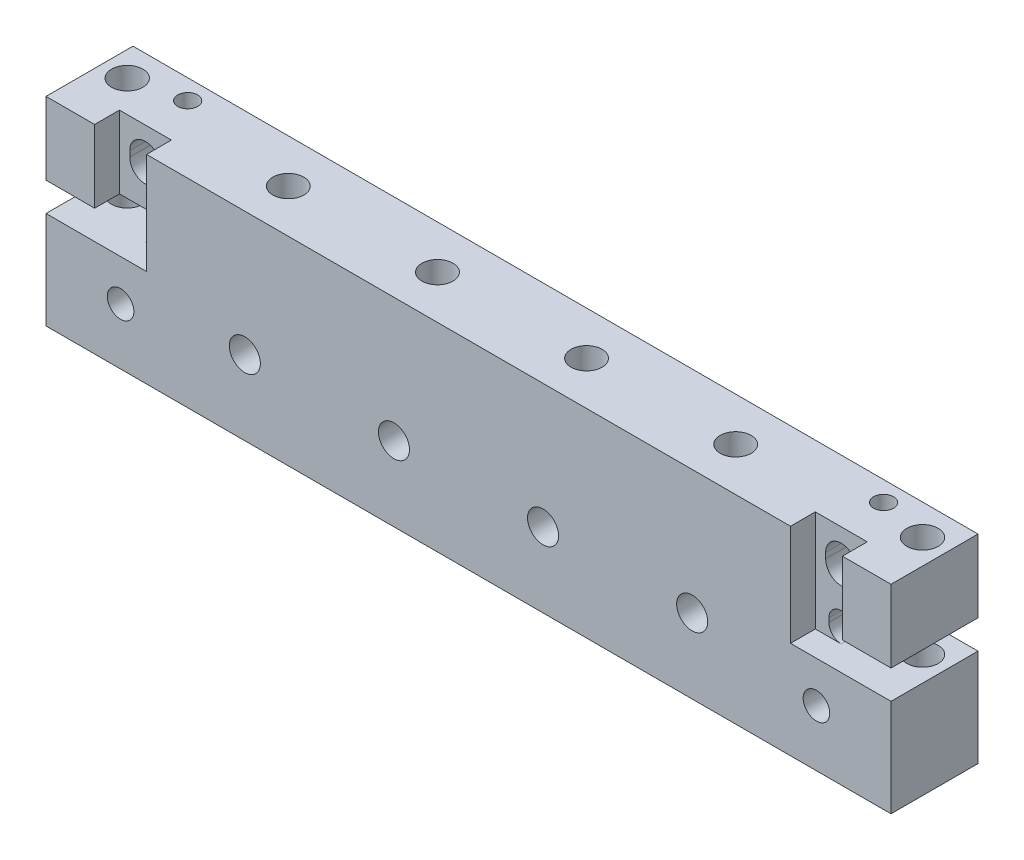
ISO-10303-21;
HEADER;
FILE_DESCRIPTION(('STEP AP214'),'2;1');
FILE_NAME('part.step','',(''),(''),'','','');
FILE_SCHEMA(('AUTOMOTIVE_DESIGN { 1 0 10303 214 1 1 1 1 }'));
ENDSEC;
DATA;
#1=APPLICATION_CONTEXT('core data for automotive mechanical design processes');
#2=APPLICATION_PROTOCOL_DEFINITION('international standard','automotive_design',2000,#1);
#3=PRODUCT_CONTEXT('',#1,'mechanical');
#4=PRODUCT('Part','Part','',(#3));
#5=PRODUCT_RELATED_PRODUCT_CATEGORY('part','',(#4));
#6=PRODUCT_DEFINITION_FORMATION('','',#4);
#7=PRODUCT_DEFINITION_CONTEXT('part definition',#1,'design');
#8=PRODUCT_DEFINITION('design','',#6,#7);
#9=PRODUCT_DEFINITION_SHAPE('','',#8);
#10=(LENGTH_UNIT() NAMED_UNIT(*) SI_UNIT(.MILLI.,.METRE.));
#11=(NAMED_UNIT(*) PLANE_ANGLE_UNIT() SI_UNIT($,.RADIAN.));
#12=(NAMED_UNIT(*) SI_UNIT($,.STERADIAN.) SOLID_ANGLE_UNIT());
#13=UNCERTAINTY_MEASURE_WITH_UNIT(LENGTH_MEASURE(1.E-05),#10,'distance_accuracy_value','');
#14=(GEOMETRIC_REPRESENTATION_CONTEXT(3) GLOBAL_UNCERTAINTY_ASSIGNED_CONTEXT((#13)) GLOBAL_UNIT_ASSIGNED_CONTEXT((#10,
#11,#12)) REPRESENTATION_CONTEXT('',''));
#15=CARTESIAN_POINT('',(0.,0.,0.));
#16=DIRECTION('',(0.,0.,1.));
#17=DIRECTION('',(1.,0.,0.));
#18=AXIS2_PLACEMENT_3D('',#15,#16,#17);
#19=CARTESIAN_POINT('',(0.,50.8,22.225));
#20=DIRECTION('',(0.,-1.,0.));
#21=DIRECTION('',(0.,0.,-1.));
#22=AXIS2_PLACEMENT_3D('',#19,#20,#21);
#23=PLANE('',#22);
#24=CARTESIAN_POINT('',(6.34999999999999,50.8,7.8232));
#25=DIRECTION('',(0.,1.,0.));
#26=DIRECTION('',(0.,0.,1.));
#27=AXIS2_PLACEMENT_3D('',#24,#25,#26);
#28=CIRCLE('',#27,4.01319999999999);
#29=CARTESIAN_POINT('',(6.34999999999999,50.8,11.8364));
#30=VERTEX_POINT('',#29);
#31=EDGE_CURVE('E1431',#30,#30,#28,.T.);
#32=ORIENTED_EDGE('',*,*,#31,.F.);
#33=EDGE_LOOP('',(#32));
#34=FACE_BOUND('',#33,.T.);
#35=CARTESIAN_POINT('',(209.55,50.8,7.8232));
#36=DIRECTION('',(0.,1.,0.));
#37=DIRECTION('',(0.,0.,1.));
#38=AXIS2_PLACEMENT_3D('',#35,#36,#37);
#39=CIRCLE('',#38,4.01319999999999);
#40=CARTESIAN_POINT('',(209.55,50.8,11.8364));
#41=VERTEX_POINT('',#40);
#42=EDGE_CURVE('E288',#41,#41,#39,.T.);
#43=ORIENTED_EDGE('',*,*,#42,.F.);
#44=EDGE_LOOP('',(#43));
#45=FACE_BOUND('',#44,.T.);
#46=CARTESIAN_POINT('',(196.85,50.8,5.08000000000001));
#47=DIRECTION('',(0.,1.,0.));
#48=DIRECTION('',(0.,0.,1.));
#49=AXIS2_PLACEMENT_3D('',#46,#47,#48);
#50=CIRCLE('',#49,2.55269999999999);
#51=CARTESIAN_POINT('',(196.85,50.8,7.6327));
#52=VERTEX_POINT('',#51);
#53=EDGE_CURVE('E313',#52,#52,#50,.T.);
#54=ORIENTED_EDGE('',*,*,#53,.F.);
#55=EDGE_LOOP('',(#54));
#56=FACE_BOUND('',#55,.T.);
#57=CARTESIAN_POINT('',(127.,50.8,11.1125));
#58=DIRECTION('',(0.,1.,0.));
#59=DIRECTION('',(0.,0.,1.));
#60=AXIS2_PLACEMENT_3D('',#57,#58,#59);
#61=CIRCLE('',#60,3.96874999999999);
#62=CARTESIAN_POINT('',(127.,50.8,15.08125));
#63=VERTEX_POINT('',#62);
#64=EDGE_CURVE('E946',#63,#63,#61,.T.);
#65=ORIENTED_EDGE('',*,*,#64,.F.);
#66=EDGE_LOOP('',(#65));
#67=FACE_BOUND('',#66,.T.);
#68=CARTESIAN_POINT('',(88.9,50.8,11.1125));
#69=DIRECTION('',(0.,1.,0.));
#70=DIRECTION('',(0.,0.,1.));
#71=AXIS2_PLACEMENT_3D('',#68,#69,#70);
#72=CIRCLE('',#71,3.96874999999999);
#73=CARTESIAN_POINT('',(88.9,50.8,15.08125));
#74=VERTEX_POINT('',#73);
#75=EDGE_CURVE('E943',#74,#74,#72,.T.);
#76=ORIENTED_EDGE('',*,*,#75,.F.);
#77=EDGE_LOOP('',(#76));
#78=FACE_BOUND('',#77,.T.);
#79=CARTESIAN_POINT('',(165.1,50.8,11.1125));
#80=DIRECTION('',(0.,1.,0.));
#81=DIRECTION('',(0.,0.,1.));
#82=AXIS2_PLACEMENT_3D('',#79,#80,#81);
#83=CIRCLE('',#82,3.96874999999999);
#84=CARTESIAN_POINT('',(165.1,50.8,15.08125));
#85=VERTEX_POINT('',#84);
#86=EDGE_CURVE('E939',#85,#85,#83,.T.);
#87=ORIENTED_EDGE('',*,*,#86,.F.);
#88=EDGE_LOOP('',(#87));
#89=FACE_BOUND('',#88,.T.);
#90=CARTESIAN_POINT('',(50.8,50.8,11.1125));
#91=DIRECTION('',(0.,1.,0.));
#92=DIRECTION('',(0.,0.,1.));
#93=AXIS2_PLACEMENT_3D('',#90,#91,#92);
#94=CIRCLE('',#93,3.96874999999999);
#95=CARTESIAN_POINT('',(50.8,50.8,15.08125));
#96=VERTEX_POINT('',#95);
#97=EDGE_CURVE('E751',#96,#96,#94,.T.);
#98=ORIENTED_EDGE('',*,*,#97,.F.);
#99=EDGE_LOOP('',(#98));
#100=FACE_BOUND('',#99,.T.);
#101=DIRECTION('',(-1.,0.,0.));
#102=VECTOR('',#101,1.);
#103=CARTESIAN_POINT('',(0.,50.8,22.225));
#104=LINE('',#103,#102);
#105=CARTESIAN_POINT('',(190.2206,50.8,22.225));
#106=VERTEX_POINT('',#105);
#107=CARTESIAN_POINT('',(25.6794,50.8,22.225));
#108=VERTEX_POINT('',#107);
#109=EDGE_CURVE('E705',#106,#108,#104,.T.);
#110=ORIENTED_EDGE('',*,*,#109,.F.);
#111=DIRECTION('',(0.,0.,1.));
#112=VECTOR('',#111,1.);
#113=CARTESIAN_POINT('',(190.2206,50.8,15.875));
#114=LINE('',#113,#112);
#115=CARTESIAN_POINT('',(190.2206,50.8,15.875));
#116=VERTEX_POINT('',#115);
#117=EDGE_CURVE('E766',#116,#106,#114,.T.);
#118=ORIENTED_EDGE('',*,*,#117,.F.);
#119=DIRECTION('',(-1.,0.,0.));
#120=VECTOR('',#119,1.);
#121=CARTESIAN_POINT('',(203.4794,50.8,15.875));
#122=LINE('',#121,#120);
#123=CARTESIAN_POINT('',(203.4794,50.8,15.875));
#124=VERTEX_POINT('',#123);
#125=EDGE_CURVE('E927',#124,#116,#122,.T.);
#126=ORIENTED_EDGE('',*,*,#125,.F.);
#127=DIRECTION('',(0.,0.,1.));
#128=VECTOR('',#127,1.);
#129=CARTESIAN_POINT('',(203.4794,50.8,15.875));
#130=LINE('',#129,#128);
#131=CARTESIAN_POINT('',(203.4794,50.8,22.225));
#132=VERTEX_POINT('',#131);
#133=EDGE_CURVE('E768',#124,#132,#130,.T.);
#134=ORIENTED_EDGE('',*,*,#133,.T.);
#135=CARTESIAN_POINT('',(215.9,50.8,22.225));
#136=VERTEX_POINT('',#135);
#137=EDGE_CURVE('E427',#136,#132,#104,.T.);
#138=ORIENTED_EDGE('',*,*,#137,.F.);
#139=DIRECTION('',(0.,0.,-1.));
#140=VECTOR('',#139,1.);
#141=CARTESIAN_POINT('',(215.9,50.8,22.225));
#142=LINE('',#141,#140);
#143=CARTESIAN_POINT('',(215.9,50.8,0.));
#144=VERTEX_POINT('',#143);
#145=EDGE_CURVE('E410',#136,#144,#142,.T.);
#146=ORIENTED_EDGE('',*,*,#145,.T.);
#147=DIRECTION('',(-1.,0.,0.));
#148=VECTOR('',#147,1.);
#149=CARTESIAN_POINT('',(0.,50.8,0.));
#150=LINE('',#149,#148);
#151=CARTESIAN_POINT('',(0.,50.8,0.));
#152=VERTEX_POINT('',#151);
#153=EDGE_CURVE('E418',#144,#152,#150,.T.);
#154=ORIENTED_EDGE('',*,*,#153,.T.);
#155=DIRECTION('',(0.,0.,-1.));
#156=VECTOR('',#155,1.);
#157=CARTESIAN_POINT('',(0.,50.8,22.225));
#158=LINE('',#157,#156);
#159=CARTESIAN_POINT('',(0.,50.8,22.225));
#160=VERTEX_POINT('',#159);
#161=EDGE_CURVE('E424',#160,#152,#158,.T.);
#162=ORIENTED_EDGE('',*,*,#161,.F.);
#163=CARTESIAN_POINT('',(12.4206,50.8,22.225));
#164=VERTEX_POINT('',#163);
#165=EDGE_CURVE('E704',#164,#160,#104,.T.);
#166=ORIENTED_EDGE('',*,*,#165,.F.);
#167=DIRECTION('',(0.,0.,1.));
#168=VECTOR('',#167,1.);
#169=CARTESIAN_POINT('',(12.4206,50.8,15.875));
#170=LINE('',#169,#168);
#171=CARTESIAN_POINT('',(12.4206,50.8,15.875));
#172=VERTEX_POINT('',#171);
#173=EDGE_CURVE('E805',#172,#164,#170,.T.);
#174=ORIENTED_EDGE('',*,*,#173,.F.);
#175=DIRECTION('',(-1.,0.,0.));
#176=VECTOR('',#175,1.);
#177=CARTESIAN_POINT('',(12.4206,50.8,15.875));
#178=LINE('',#177,#176);
#179=CARTESIAN_POINT('',(25.6794,50.8,15.875));
#180=VERTEX_POINT('',#179);
#181=EDGE_CURVE('E798',#180,#172,#178,.T.);
#182=ORIENTED_EDGE('',*,*,#181,.F.);
#183=DIRECTION('',(0.,0.,1.));
#184=VECTOR('',#183,1.);
#185=CARTESIAN_POINT('',(25.6794,50.8,15.875));
#186=LINE('',#185,#184);
#187=EDGE_CURVE('E808',#180,#108,#186,.T.);
#188=ORIENTED_EDGE('',*,*,#187,.T.);
#189=EDGE_LOOP('',(#110,#118,#126,#134,#138,#146,#154,#162,#166,#174,#182,#188));
#190=FACE_BOUND('',#189,.T.);
#191=CARTESIAN_POINT('',(19.05,50.8,5.08000000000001));
#192=DIRECTION('',(0.,1.,0.));
#193=DIRECTION('',(0.,0.,1.));
#194=AXIS2_PLACEMENT_3D('',#191,#192,#193);
#195=CIRCLE('',#194,2.55269999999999);
#196=CARTESIAN_POINT('',(19.05,50.8,7.6327));
#197=VERTEX_POINT('',#196);
#198=EDGE_CURVE('E292',#197,#197,#195,.T.);
#199=ORIENTED_EDGE('',*,*,#198,.F.);
#200=EDGE_LOOP('',(#199));
#201=FACE_BOUND('',#200,.T.);
#202=ADVANCED_FACE('F36',(#34,#45,#56,#67,#78,#89,#100,#190,#201),#23,.F.);
#203=CARTESIAN_POINT('',(127.,19.05,22.225));
#204=DIRECTION('',(0.,0.,1.));
#205=DIRECTION('',(1.,0.,0.));
#206=AXIS2_PLACEMENT_3D('',#203,#204,#205);
#207=CYLINDRICAL_SURFACE('',#206,3.96874999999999);
#208=CARTESIAN_POINT('',(127.,19.05,22.225));
#209=DIRECTION('',(0.,0.,1.));
#210=DIRECTION('',(1.,0.,0.));
#211=AXIS2_PLACEMENT_3D('',#208,#209,#210);
#212=CIRCLE('',#211,3.96874999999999);
#213=CARTESIAN_POINT('',(130.96875,19.05,22.225));
#214=VERTEX_POINT('',#213);
#215=EDGE_CURVE('E879',#214,#214,#212,.T.);
#216=ORIENTED_EDGE('',*,*,#215,.T.);
#217=EDGE_LOOP('',(#216));
#218=FACE_BOUND('',#217,.T.);
#219=CARTESIAN_POINT('',(127.,19.05,11.1125));
#220=DIRECTION('',(0.,-0.707106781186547,0.707106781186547));
#221=DIRECTION('',(0.,0.707106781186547,0.707106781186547));
#222=AXIS2_PLACEMENT_3D('',#219,#220,#221);
#223=ELLIPSE('',#222,5.61266007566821,3.96874999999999);
#224=CARTESIAN_POINT('',(123.03125,19.05,11.1125));
#225=VERTEX_POINT('',#224);
#226=CARTESIAN_POINT('',(130.96875,19.05,11.1125));
#227=VERTEX_POINT('',#226);
#228=EDGE_CURVE('E51',#225,#227,#223,.F.);
#229=ORIENTED_EDGE('',*,*,#228,.T.);
#230=CARTESIAN_POINT('',(127.,19.05,11.1125));
#231=DIRECTION('',(0.,0.707106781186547,0.707106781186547));
#232=DIRECTION('',(0.,-0.707106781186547,0.707106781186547));
#233=AXIS2_PLACEMENT_3D('',#230,#231,#232);
#234=ELLIPSE('',#233,5.61266007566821,3.96874999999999);
#235=EDGE_CURVE('E11',#227,#225,#234,.F.);
#236=ORIENTED_EDGE('',*,*,#235,.T.);
#237=EDGE_LOOP('',(#229,#236));
#238=FACE_BOUND('',#237,.T.);
#239=ADVANCED_FACE('F281',(#218,#238),#207,.F.);
#240=CARTESIAN_POINT('',(88.9,19.05,22.225));
#241=DIRECTION('',(0.,0.,1.));
#242=DIRECTION('',(1.,0.,0.));
#243=AXIS2_PLACEMENT_3D('',#240,#241,#242);
#244=CYLINDRICAL_SURFACE('',#243,3.96874999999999);
#245=CARTESIAN_POINT('',(88.9,19.05,22.225));
#246=DIRECTION('',(0.,0.,1.));
#247=DIRECTION('',(1.,0.,0.));
#248=AXIS2_PLACEMENT_3D('',#245,#246,#247);
#249=CIRCLE('',#248,3.96874999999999);
#250=CARTESIAN_POINT('',(92.86875,19.05,22.225));
#251=VERTEX_POINT('',#250);
#252=EDGE_CURVE('E865',#251,#251,#249,.T.);
#253=ORIENTED_EDGE('',*,*,#252,.T.);
#254=EDGE_LOOP('',(#253));
#255=FACE_BOUND('',#254,.T.);
#256=CARTESIAN_POINT('',(88.9,19.05,11.1125));
#257=DIRECTION('',(0.,-0.707106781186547,0.707106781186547));
#258=DIRECTION('',(0.,0.707106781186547,0.707106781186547));
#259=AXIS2_PLACEMENT_3D('',#256,#257,#258);
#260=ELLIPSE('',#259,5.61266007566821,3.96874999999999);
#261=CARTESIAN_POINT('',(84.93125,19.05,11.1125));
#262=VERTEX_POINT('',#261);
#263=CARTESIAN_POINT('',(92.86875,19.05,11.1125));
#264=VERTEX_POINT('',#263);
#265=EDGE_CURVE('E58',#262,#264,#260,.F.);
#266=ORIENTED_EDGE('',*,*,#265,.T.);
#267=CARTESIAN_POINT('',(88.9,19.05,11.1125));
#268=DIRECTION('',(0.,0.707106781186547,0.707106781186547));
#269=DIRECTION('',(0.,-0.707106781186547,0.707106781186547));
#270=AXIS2_PLACEMENT_3D('',#267,#268,#269);
#271=ELLIPSE('',#270,5.61266007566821,3.96874999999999);
#272=EDGE_CURVE('E279',#264,#262,#271,.F.);
#273=ORIENTED_EDGE('',*,*,#272,.T.);
#274=EDGE_LOOP('',(#266,#273));
#275=FACE_BOUND('',#274,.T.);
#276=ADVANCED_FACE('F344',(#255,#275),#244,.F.);
#277=CARTESIAN_POINT('',(165.1,19.05,22.225));
#278=DIRECTION('',(0.,0.,1.));
#279=DIRECTION('',(1.,0.,0.));
#280=AXIS2_PLACEMENT_3D('',#277,#278,#279);
#281=CYLINDRICAL_SURFACE('',#280,3.96874999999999);
#282=CARTESIAN_POINT('',(165.1,19.05,22.225));
#283=DIRECTION('',(0.,0.,1.));
#284=DIRECTION('',(1.,0.,0.));
#285=AXIS2_PLACEMENT_3D('',#282,#283,#284);
#286=CIRCLE('',#285,3.96874999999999);
#287=CARTESIAN_POINT('',(169.06875,19.05,22.225));
#288=VERTEX_POINT('',#287);
#289=EDGE_CURVE('E885',#288,#288,#286,.T.);
#290=ORIENTED_EDGE('',*,*,#289,.T.);
#291=EDGE_LOOP('',(#290));
#292=FACE_BOUND('',#291,.T.);
#293=CARTESIAN_POINT('',(165.1,19.05,11.1125));
#294=DIRECTION('',(0.,-0.707106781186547,0.707106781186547));
#295=DIRECTION('',(0.,0.707106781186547,0.707106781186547));
#296=AXIS2_PLACEMENT_3D('',#293,#294,#295);
#297=ELLIPSE('',#296,5.61266007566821,3.96874999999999);
#298=CARTESIAN_POINT('',(161.13125,19.05,11.1125));
#299=VERTEX_POINT('',#298);
#300=CARTESIAN_POINT('',(169.06875,19.05,11.1125));
#301=VERTEX_POINT('',#300);
#302=EDGE_CURVE('E453',#299,#301,#297,.F.);
#303=ORIENTED_EDGE('',*,*,#302,.T.);
#304=CARTESIAN_POINT('',(165.1,19.05,11.1125));
#305=DIRECTION('',(0.,0.707106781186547,0.707106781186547));
#306=DIRECTION('',(0.,-0.707106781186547,0.707106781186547));
#307=AXIS2_PLACEMENT_3D('',#304,#305,#306);
#308=ELLIPSE('',#307,5.61266007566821,3.96874999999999);
#309=EDGE_CURVE('E461',#301,#299,#308,.F.);
#310=ORIENTED_EDGE('',*,*,#309,.T.);
#311=EDGE_LOOP('',(#303,#310));
#312=FACE_BOUND('',#311,.T.);
#313=ADVANCED_FACE('F565',(#292,#312),#281,.F.);
#314=CARTESIAN_POINT('',(50.8,19.05,22.225));
#315=DIRECTION('',(0.,0.,1.));
#316=DIRECTION('',(1.,0.,0.));
#317=AXIS2_PLACEMENT_3D('',#314,#315,#316);
#318=CYLINDRICAL_SURFACE('',#317,3.96874999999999);
#319=CARTESIAN_POINT('',(50.8,19.05,22.225));
#320=DIRECTION('',(0.,0.,1.));
#321=DIRECTION('',(1.,0.,0.));
#322=AXIS2_PLACEMENT_3D('',#319,#320,#321);
#323=CIRCLE('',#322,3.96874999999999);
#324=CARTESIAN_POINT('',(54.76875,19.05,22.225));
#325=VERTEX_POINT('',#324);
#326=EDGE_CURVE('E891',#325,#325,#323,.T.);
#327=ORIENTED_EDGE('',*,*,#326,.T.);
#328=EDGE_LOOP('',(#327));
#329=FACE_BOUND('',#328,.T.);
#330=CARTESIAN_POINT('',(50.8,19.05,11.1125));
#331=DIRECTION('',(0.,-0.707106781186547,0.707106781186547));
#332=DIRECTION('',(0.,0.707106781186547,0.707106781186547));
#333=AXIS2_PLACEMENT_3D('',#330,#331,#332);
#334=ELLIPSE('',#333,5.61266007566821,3.96874999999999);
#335=CARTESIAN_POINT('',(46.83125,19.05,11.1125));
#336=VERTEX_POINT('',#335);
#337=CARTESIAN_POINT('',(54.76875,19.05,11.1125));
#338=VERTEX_POINT('',#337);
#339=EDGE_CURVE('E442',#336,#338,#334,.F.);
#340=ORIENTED_EDGE('',*,*,#339,.T.);
#341=CARTESIAN_POINT('',(50.8,19.05,11.1125));
#342=DIRECTION('',(0.,0.707106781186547,0.707106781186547));
#343=DIRECTION('',(0.,-0.707106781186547,0.707106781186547));
#344=AXIS2_PLACEMENT_3D('',#341,#342,#343);
#345=ELLIPSE('',#344,5.61266007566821,3.96874999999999);
#346=EDGE_CURVE('E450',#338,#336,#345,.F.);
#347=ORIENTED_EDGE('',*,*,#346,.T.);
#348=EDGE_LOOP('',(#340,#347));
#349=FACE_BOUND('',#348,.T.);
#350=ADVANCED_FACE('F570',(#329,#349),#318,.F.);
#351=CARTESIAN_POINT('',(0.,50.8,22.225));
#352=DIRECTION('',(0.,0.,-1.));
#353=DIRECTION('',(-1.,0.,0.));
#354=AXIS2_PLACEMENT_3D('',#351,#352,#353);
#355=PLANE('',#354);
#356=CARTESIAN_POINT('',(19.05,14.4,22.225));
#357=DIRECTION('',(0.,0.,1.));
#358=DIRECTION('',(1.,0.,0.));
#359=AXIS2_PLACEMENT_3D('',#356,#357,#358);
#360=CIRCLE('',#359,3.39999999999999);
#361=CARTESIAN_POINT('',(22.45,14.4,22.225));
#362=VERTEX_POINT('',#361);
#363=EDGE_CURVE('E644',#362,#362,#360,.T.);
#364=ORIENTED_EDGE('',*,*,#363,.F.);
#365=EDGE_LOOP('',(#364));
#366=FACE_BOUND('',#365,.T.);
#367=CARTESIAN_POINT('',(196.85,14.4,22.225));
#368=DIRECTION('',(0.,0.,1.));
#369=DIRECTION('',(1.,0.,0.));
#370=AXIS2_PLACEMENT_3D('',#367,#368,#369);
#371=CIRCLE('',#370,3.39999999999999);
#372=CARTESIAN_POINT('',(200.25,14.4,22.225));
#373=VERTEX_POINT('',#372);
#374=EDGE_CURVE('E900',#373,#373,#371,.T.);
#375=ORIENTED_EDGE('',*,*,#374,.F.);
#376=EDGE_LOOP('',(#375));
#377=FACE_BOUND('',#376,.T.);
#378=ORIENTED_EDGE('',*,*,#326,.F.);
#379=EDGE_LOOP('',(#378));
#380=FACE_BOUND('',#379,.T.);
#381=ORIENTED_EDGE('',*,*,#289,.F.);
#382=EDGE_LOOP('',(#381));
#383=FACE_BOUND('',#382,.T.);
#384=ORIENTED_EDGE('',*,*,#215,.F.);
#385=EDGE_LOOP('',(#384));
#386=FACE_BOUND('',#385,.T.);
#387=ORIENTED_EDGE('',*,*,#252,.F.);
#388=EDGE_LOOP('',(#387));
#389=FACE_BOUND('',#388,.T.);
#390=DIRECTION('',(1.,0.,0.));
#391=VECTOR('',#390,1.);
#392=CARTESIAN_POINT('',(215.9,24.892,22.225));
#393=LINE('',#392,#391);
#394=CARTESIAN_POINT('',(190.2206,24.892,22.225));
#395=VERTEX_POINT('',#394);
#396=CARTESIAN_POINT('',(215.9,24.892,22.225));
#397=VERTEX_POINT('',#396);
#398=EDGE_CURVE('E670',#395,#397,#393,.T.);
#399=ORIENTED_EDGE('',*,*,#398,.F.);
#400=DIRECTION('',(0.,-1.,0.));
#401=VECTOR('',#400,1.);
#402=CARTESIAN_POINT('',(190.2206,50.8,22.225));
#403=LINE('',#402,#401);
#404=EDGE_CURVE('E750',#106,#395,#403,.T.);
#405=ORIENTED_EDGE('',*,*,#404,.F.);
#406=ORIENTED_EDGE('',*,*,#109,.T.);
#407=DIRECTION('',(0.,1.,0.));
#408=VECTOR('',#407,1.);
#409=CARTESIAN_POINT('',(25.6794,50.8,22.225));
#410=LINE('',#409,#408);
#411=CARTESIAN_POINT('',(25.6794,24.892,22.225));
#412=VERTEX_POINT('',#411);
#413=EDGE_CURVE('E793',#412,#108,#410,.T.);
#414=ORIENTED_EDGE('',*,*,#413,.F.);
#415=DIRECTION('',(1.,0.,0.));
#416=VECTOR('',#415,1.);
#417=CARTESIAN_POINT('',(0.,24.892,22.225));
#418=LINE('',#417,#416);
#419=CARTESIAN_POINT('',(0.,24.892,22.225));
#420=VERTEX_POINT('',#419);
#421=EDGE_CURVE('E639',#420,#412,#418,.T.);
#422=ORIENTED_EDGE('',*,*,#421,.F.);
#423=DIRECTION('',(0.,-1.,0.));
#424=VECTOR('',#423,1.);
#425=CARTESIAN_POINT('',(0.,0.,22.225));
#426=LINE('',#425,#424);
#427=CARTESIAN_POINT('',(0.,0.,22.225));
#428=VERTEX_POINT('',#427);
#429=EDGE_CURVE('E420',#420,#428,#426,.T.);
#430=ORIENTED_EDGE('',*,*,#429,.T.);
#431=DIRECTION('',(1.,0.,0.));
#432=VECTOR('',#431,1.);
#433=CARTESIAN_POINT('',(0.,0.,22.225));
#434=LINE('',#433,#432);
#435=CARTESIAN_POINT('',(215.9,0.,22.225));
#436=VERTEX_POINT('',#435);
#437=EDGE_CURVE('E700',#428,#436,#434,.T.);
#438=ORIENTED_EDGE('',*,*,#437,.T.);
#439=DIRECTION('',(0.,1.,0.));
#440=VECTOR('',#439,1.);
#441=CARTESIAN_POINT('',(215.9,0.,22.225));
#442=LINE('',#441,#440);
#443=EDGE_CURVE('E409',#436,#397,#442,.T.);
#444=ORIENTED_EDGE('',*,*,#443,.T.);
#445=EDGE_LOOP('',(#399,#405,#406,#414,#422,#430,#438,#444));
#446=FACE_BOUND('',#445,.T.);
#447=ADVANCED_FACE('F618',(#366,#377,#380,#383,#386,#389,#446),#355,.F.);
#448=DIRECTION('',(-1.,0.,0.));
#449=VECTOR('',#448,1.);
#450=CARTESIAN_POINT('',(0.,32.258,22.225));
#451=LINE('',#450,#449);
#452=CARTESIAN_POINT('',(12.4206,32.258,22.225));
#453=VERTEX_POINT('',#452);
#454=CARTESIAN_POINT('',(0.,32.258,22.225));
#455=VERTEX_POINT('',#454);
#456=EDGE_CURVE('E631',#453,#455,#451,.T.);
#457=ORIENTED_EDGE('',*,*,#456,.F.);
#458=DIRECTION('',(0.,-1.,0.));
#459=VECTOR('',#458,1.);
#460=CARTESIAN_POINT('',(12.4206,50.8,22.225));
#461=LINE('',#460,#459);
#462=EDGE_CURVE('E632',#164,#453,#461,.T.);
#463=ORIENTED_EDGE('',*,*,#462,.F.);
#464=ORIENTED_EDGE('',*,*,#165,.T.);
#465=EDGE_CURVE('E635',#160,#455,#426,.T.);
#466=ORIENTED_EDGE('',*,*,#465,.T.);
#467=EDGE_LOOP('',(#457,#463,#464,#466));
#468=FACE_BOUND('',#467,.T.);
#469=ADVANCED_FACE('F588',(#468),#355,.F.);
#470=CARTESIAN_POINT('',(19.05,29.083,0.));
#471=DIRECTION('',(0.,0.,1.));
#472=DIRECTION('',(1.,0.,0.));
#473=AXIS2_PLACEMENT_3D('',#470,#471,#472);
#474=CYLINDRICAL_SURFACE('',#473,3.17500000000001);
#475=CARTESIAN_POINT('',(19.05,29.083,15.875));
#476=DIRECTION('',(0.,0.,1.));
#477=DIRECTION('',(1.,0.,0.));
#478=AXIS2_PLACEMENT_3D('',#475,#476,#477);
#479=CIRCLE('',#478,3.17500000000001);
#480=CARTESIAN_POINT('',(19.05,32.258,15.875));
#481=VERTEX_POINT('',#480);
#482=CARTESIAN_POINT('',(22.225,29.083,15.875));
#483=VERTEX_POINT('',#482);
#484=EDGE_CURVE('E821',#481,#483,#479,.F.);
#485=ORIENTED_EDGE('',*,*,#484,.F.);
#486=DIRECTION('',(0.,0.,1.));
#487=VECTOR('',#486,1.);
#488=CARTESIAN_POINT('',(19.05,32.258,0.));
#489=LINE('',#488,#487);
#490=CARTESIAN_POINT('',(19.05,32.258,0.));
#491=VERTEX_POINT('',#490);
#492=EDGE_CURVE('E651',#491,#481,#489,.T.);
#493=ORIENTED_EDGE('',*,*,#492,.F.);
#494=CARTESIAN_POINT('',(19.05,29.083,0.));
#495=DIRECTION('',(0.,0.,1.));
#496=DIRECTION('',(1.,0.,0.));
#497=AXIS2_PLACEMENT_3D('',#494,#495,#496);
#498=CIRCLE('',#497,3.17500000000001);
#499=CARTESIAN_POINT('',(22.225,29.083,0.));
#500=VERTEX_POINT('',#499);
#501=EDGE_CURVE('E724',#500,#491,#498,.T.);
#502=ORIENTED_EDGE('',*,*,#501,.F.);
#503=DIRECTION('',(0.,0.,1.));
#504=VECTOR('',#503,1.);
#505=CARTESIAN_POINT('',(22.225,29.083,0.));
#506=LINE('',#505,#504);
#507=EDGE_CURVE('E654',#500,#483,#506,.T.);
#508=ORIENTED_EDGE('',*,*,#507,.T.);
#509=EDGE_LOOP('',(#485,#493,#502,#508));
#510=FACE_BOUND('',#509,.T.);
#511=ADVANCED_FACE('F584',(#510),#474,.F.);
#512=CARTESIAN_POINT('',(22.225,29.083,0.));
#513=DIRECTION('',(1.,0.,0.));
#514=DIRECTION('',(0.,0.,-1.));
#515=AXIS2_PLACEMENT_3D('',#512,#513,#514);
#516=PLANE('',#515);
#517=DIRECTION('',(0.,-1.,0.));
#518=VECTOR('',#517,1.);
#519=CARTESIAN_POINT('',(22.225,29.083,15.875));
#520=LINE('',#519,#518);
#521=CARTESIAN_POINT('',(22.225,28.067,15.875));
#522=VERTEX_POINT('',#521);
#523=EDGE_CURVE('E819',#483,#522,#520,.T.);
#524=ORIENTED_EDGE('',*,*,#523,.F.);
#525=ORIENTED_EDGE('',*,*,#507,.F.);
#526=DIRECTION('',(0.,1.,0.));
#527=VECTOR('',#526,1.);
#528=CARTESIAN_POINT('',(22.225,29.083,0.));
#529=LINE('',#528,#527);
#530=CARTESIAN_POINT('',(22.225,28.067,0.));
#531=VERTEX_POINT('',#530);
#532=EDGE_CURVE('E722',#531,#500,#529,.T.);
#533=ORIENTED_EDGE('',*,*,#532,.F.);
#534=DIRECTION('',(0.,0.,1.));
#535=VECTOR('',#534,1.);
#536=CARTESIAN_POINT('',(22.225,28.067,0.));
#537=LINE('',#536,#535);
#538=EDGE_CURVE('E657',#531,#522,#537,.T.);
#539=ORIENTED_EDGE('',*,*,#538,.T.);
#540=EDGE_LOOP('',(#524,#525,#533,#539));
#541=FACE_BOUND('',#540,.T.);
#542=ADVANCED_FACE('F587',(#541),#516,.F.);
#543=CARTESIAN_POINT('',(19.05,28.067,0.));
#544=DIRECTION('',(0.,0.,1.));
#545=DIRECTION('',(1.,0.,0.));
#546=AXIS2_PLACEMENT_3D('',#543,#544,#545);
#547=CYLINDRICAL_SURFACE('',#546,3.175);
#548=CARTESIAN_POINT('',(19.05,28.067,15.875));
#549=DIRECTION('',(0.,0.,1.));
#550=DIRECTION('',(1.,0.,0.));
#551=AXIS2_PLACEMENT_3D('',#548,#549,#550);
#552=CIRCLE('',#551,3.175);
#553=CARTESIAN_POINT('',(19.05,24.892,15.875));
#554=VERTEX_POINT('',#553);
#555=EDGE_CURVE('E720',#522,#554,#552,.F.);
#556=ORIENTED_EDGE('',*,*,#555,.F.);
#557=ORIENTED_EDGE('',*,*,#538,.F.);
#558=CARTESIAN_POINT('',(19.05,28.067,0.));
#559=DIRECTION('',(0.,0.,1.));
#560=DIRECTION('',(1.,0.,0.));
#561=AXIS2_PLACEMENT_3D('',#558,#559,#560);
#562=CIRCLE('',#561,3.175);
#563=CARTESIAN_POINT('',(19.05,24.892,0.));
#564=VERTEX_POINT('',#563);
#565=EDGE_CURVE('E642',#564,#531,#562,.T.);
#566=ORIENTED_EDGE('',*,*,#565,.F.);
#567=DIRECTION('',(0.,0.,1.));
#568=VECTOR('',#567,1.);
#569=CARTESIAN_POINT('',(19.05,24.892,0.));
#570=LINE('',#569,#568);
#571=EDGE_CURVE('E660',#564,#554,#570,.T.);
#572=ORIENTED_EDGE('',*,*,#571,.T.);
#573=EDGE_LOOP('',(#556,#557,#566,#572));
#574=FACE_BOUND('',#573,.T.);
#575=ADVANCED_FACE('F540',(#574),#547,.F.);
#576=CARTESIAN_POINT('',(19.05,41.75,0.));
#577=DIRECTION('',(0.,0.,1.));
#578=DIRECTION('',(1.,0.,0.));
#579=AXIS2_PLACEMENT_3D('',#576,#577,#578);
#580=CYLINDRICAL_SURFACE('',#579,4.);
#581=CARTESIAN_POINT('',(19.05,41.75,15.875));
#582=DIRECTION('',(0.,0.,1.));
#583=DIRECTION('',(1.,0.,0.));
#584=AXIS2_PLACEMENT_3D('',#581,#582,#583);
#585=CIRCLE('',#584,4.);
#586=CARTESIAN_POINT('',(23.05,41.75,15.875));
#587=VERTEX_POINT('',#586);
#588=CARTESIAN_POINT('',(15.05,41.75,15.875));
#589=VERTEX_POINT('',#588);
#590=EDGE_CURVE('E816',#587,#589,#585,.F.);
#591=ORIENTED_EDGE('',*,*,#590,.F.);
#592=DIRECTION('',(0.,0.,1.));
#593=VECTOR('',#592,1.);
#594=CARTESIAN_POINT('',(23.05,41.75,0.));
#595=LINE('',#594,#593);
#596=CARTESIAN_POINT('',(23.05,41.75,0.));
#597=VERTEX_POINT('',#596);
#598=EDGE_CURVE('E837',#597,#587,#595,.T.);
#599=ORIENTED_EDGE('',*,*,#598,.F.);
#600=CARTESIAN_POINT('',(19.05,41.75,0.));
#601=DIRECTION('',(0.,0.,1.));
#602=DIRECTION('',(1.,0.,0.));
#603=AXIS2_PLACEMENT_3D('',#600,#601,#602);
#604=CIRCLE('',#603,4.);
#605=CARTESIAN_POINT('',(15.05,41.75,0.));
#606=VERTEX_POINT('',#605);
#607=EDGE_CURVE('E825',#606,#597,#604,.T.);
#608=ORIENTED_EDGE('',*,*,#607,.F.);
#609=DIRECTION('',(0.,0.,1.));
#610=VECTOR('',#609,1.);
#611=CARTESIAN_POINT('',(15.05,41.75,0.));
#612=LINE('',#611,#610);
#613=EDGE_CURVE('E838',#606,#589,#612,.T.);
#614=ORIENTED_EDGE('',*,*,#613,.T.);
#615=EDGE_LOOP('',(#591,#599,#608,#614));
#616=FACE_BOUND('',#615,.T.);
#617=ADVANCED_FACE('F529',(#616),#580,.F.);
#618=CARTESIAN_POINT('',(15.05,41.75,0.));
#619=DIRECTION('',(-1.,0.,0.));
#620=DIRECTION('',(0.,0.,1.));
#621=AXIS2_PLACEMENT_3D('',#618,#619,#620);
#622=PLANE('',#621);
#623=DIRECTION('',(0.,1.,0.));
#624=VECTOR('',#623,1.);
#625=CARTESIAN_POINT('',(15.05,41.75,15.875));
#626=LINE('',#625,#624);
#627=CARTESIAN_POINT('',(15.05,43.18,15.875));
#628=VERTEX_POINT('',#627);
#629=EDGE_CURVE('E814',#589,#628,#626,.T.);
#630=ORIENTED_EDGE('',*,*,#629,.F.);
#631=ORIENTED_EDGE('',*,*,#613,.F.);
#632=DIRECTION('',(0.,-1.,0.));
#633=VECTOR('',#632,1.);
#634=CARTESIAN_POINT('',(15.05,41.75,0.));
#635=LINE('',#634,#633);
#636=CARTESIAN_POINT('',(15.05,43.18,0.));
#637=VERTEX_POINT('',#636);
#638=EDGE_CURVE('E834',#637,#606,#635,.T.);
#639=ORIENTED_EDGE('',*,*,#638,.F.);
#640=DIRECTION('',(0.,0.,1.));
#641=VECTOR('',#640,1.);
#642=CARTESIAN_POINT('',(15.05,43.18,0.));
#643=LINE('',#642,#641);
#644=EDGE_CURVE('E842',#637,#628,#643,.T.);
#645=ORIENTED_EDGE('',*,*,#644,.T.);
#646=EDGE_LOOP('',(#630,#631,#639,#645));
#647=FACE_BOUND('',#646,.T.);
#648=ADVANCED_FACE('F525',(#647),#622,.F.);
#649=CARTESIAN_POINT('',(19.05,43.18,0.));
#650=DIRECTION('',(0.,0.,1.));
#651=DIRECTION('',(1.,0.,0.));
#652=AXIS2_PLACEMENT_3D('',#649,#650,#651);
#653=CYLINDRICAL_SURFACE('',#652,4.);
#654=CARTESIAN_POINT('',(19.05,47.18,7.63270000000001));
#655=CARTESIAN_POINT('',(19.1792115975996,47.1799899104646,7.63268902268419));
#656=CARTESIAN_POINT('',(19.3085635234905,47.1736742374,7.62282276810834));
#657=CARTESIAN_POINT('',(19.5632642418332,47.1490063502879,7.5838980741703));
#658=CARTESIAN_POINT('',(19.6886058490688,47.1306336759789,7.55480701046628));
#659=CARTESIAN_POINT('',(19.9311168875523,47.0836927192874,7.47915978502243));
#660=CARTESIAN_POINT('',(20.0483235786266,47.0551751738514,7.43269047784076));
#661=CARTESIAN_POINT('',(20.2728441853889,46.9902925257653,7.3242131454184));
#662=CARTESIAN_POINT('',(20.3801587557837,46.953927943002,7.26220614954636));
#663=CARTESIAN_POINT('',(20.5917458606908,46.8728144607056,7.1188570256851));
#664=CARTESIAN_POINT('',(20.6950567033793,46.8276236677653,7.03635052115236));
#665=CARTESIAN_POINT('',(20.8873024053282,46.73467979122,6.85705064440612));
#666=CARTESIAN_POINT('',(20.9762170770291,46.6869232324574,6.76023756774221));
#667=CARTESIAN_POINT('',(21.1500508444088,46.5860601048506,6.53897100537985));
#668=CARTESIAN_POINT('',(21.2325984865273,46.5331599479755,6.41254467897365));
#669=CARTESIAN_POINT('',(21.3750717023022,46.4359935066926,6.14454082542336));
#670=CARTESIAN_POINT('',(21.4350360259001,46.3917124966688,6.00298979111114));
#671=CARTESIAN_POINT('',(21.5165440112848,46.3292947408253,5.74729823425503));
#672=CARTESIAN_POINT('',(21.5440815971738,46.3073302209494,5.63601007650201));
#673=CARTESIAN_POINT('',(21.5839975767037,46.2750824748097,5.4091617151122));
#674=CARTESIAN_POINT('',(21.5963988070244,46.2647816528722,5.29360821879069));
#675=CARTESIAN_POINT('',(21.6052870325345,46.2574258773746,5.06109887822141));
#676=CARTESIAN_POINT('',(21.6017257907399,46.2604110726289,4.94413985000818));
#677=CARTESIAN_POINT('',(21.5788289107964,46.2792300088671,4.71279641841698));
#678=CARTESIAN_POINT('',(21.5594802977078,46.2950743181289,4.59841421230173));
#679=CARTESIAN_POINT('',(21.5069430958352,46.3366591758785,4.37847229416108));
#680=CARTESIAN_POINT('',(21.4741706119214,46.3621005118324,4.2727531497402));
#681=CARTESIAN_POINT('',(21.3961479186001,46.420053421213,4.06813435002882));
#682=CARTESIAN_POINT('',(21.3508935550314,46.4525673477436,3.9692369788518));
#683=CARTESIAN_POINT('',(21.2391907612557,46.5285563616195,3.76080728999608));
#684=CARTESIAN_POINT('',(21.1703391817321,46.5729365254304,3.65289432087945));
#685=CARTESIAN_POINT('',(21.0177753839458,46.6636410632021,3.44893163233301));
#686=CARTESIAN_POINT('',(20.934045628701,46.7099676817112,3.35289614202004));
#687=CARTESIAN_POINT('',(20.7363613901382,46.8091191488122,3.15774386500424));
#688=CARTESIAN_POINT('',(20.6196792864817,46.8616105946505,3.06119049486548));
#689=CARTESIAN_POINT('',(20.3688408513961,46.9587145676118,2.8891110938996));
#690=CARTESIAN_POINT('',(20.2347035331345,47.0033355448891,2.81356246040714));
#691=CARTESIAN_POINT('',(19.979989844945,47.0721620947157,2.69949012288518));
#692=CARTESIAN_POINT('',(19.8619901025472,47.0986608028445,2.65659675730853));
#693=CARTESIAN_POINT('',(19.6192247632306,47.1412024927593,2.58839004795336));
#694=CARTESIAN_POINT('',(19.4944646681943,47.1572538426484,2.56306263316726));
#695=CARTESIAN_POINT('',(19.2411653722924,47.1774545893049,2.53126033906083));
#696=CARTESIAN_POINT('',(19.1126151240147,47.181564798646,2.52484753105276));
#697=CARTESIAN_POINT('',(18.8562117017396,47.1773597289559,2.53143786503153));
#698=CARTESIAN_POINT('',(18.7283585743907,47.1690436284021,2.54444229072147));
#699=CARTESIAN_POINT('',(18.4838883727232,47.1415497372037,2.58792948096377));
#700=CARTESIAN_POINT('',(18.36703283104,47.1229597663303,2.61746736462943));
#701=CARTESIAN_POINT('',(18.1402300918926,47.0768864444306,2.69193496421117));
#702=CARTESIAN_POINT('',(18.0302840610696,47.0494015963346,2.73686727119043));
#703=CARTESIAN_POINT('',(17.8113132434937,46.9852114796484,2.84439870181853));
#704=CARTESIAN_POINT('',(17.7029761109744,46.9479692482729,2.90807016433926));
#705=CARTESIAN_POINT('',(17.4979943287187,46.8682783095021,3.04946189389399));
#706=CARTESIAN_POINT('',(17.4013589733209,46.8258255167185,3.12719320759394));
#707=CARTESIAN_POINT('',(17.2070815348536,46.7320381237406,3.3079609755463));
#708=CARTESIAN_POINT('',(17.111521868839,46.680334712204,3.41304806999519));
#709=CARTESIAN_POINT('',(16.9386717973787,46.5788731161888,3.63822585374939));
#710=CARTESIAN_POINT('',(16.8613844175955,46.5291152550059,3.75831902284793));
#711=CARTESIAN_POINT('',(16.736349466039,46.4437302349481,3.99437825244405));
#712=CARTESIAN_POINT('',(16.6859877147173,46.4071002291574,4.10859250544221));
#713=CARTESIAN_POINT('',(16.6019802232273,46.3438580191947,4.34569450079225));
#714=CARTESIAN_POINT('',(16.5683111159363,46.3172318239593,4.46856984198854));
#715=CARTESIAN_POINT('',(16.5316296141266,46.2877399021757,4.65775315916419));
#716=CARTESIAN_POINT('',(16.5216910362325,46.2796359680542,4.72197601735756));
#717=CARTESIAN_POINT('',(16.5067287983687,46.2673725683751,4.85135218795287));
#718=CARTESIAN_POINT('',(16.5017026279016,46.2632110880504,4.91650500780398));
#719=CARTESIAN_POINT('',(16.496675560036,46.2590494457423,5.04711768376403));
#720=CARTESIAN_POINT('',(16.4966730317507,46.2590479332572,5.11257743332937));
#721=CARTESIAN_POINT('',(16.5016802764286,46.263192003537,5.24315245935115));
#722=CARTESIAN_POINT('',(16.5066896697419,46.2673372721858,5.30826776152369));
#723=CARTESIAN_POINT('',(16.5269876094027,46.28398268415,5.48389371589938));
#724=CARTESIAN_POINT('',(16.5470675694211,46.3003395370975,5.59353130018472));
#725=CARTESIAN_POINT('',(16.6006660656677,46.3425784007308,5.8075033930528));
#726=CARTESIAN_POINT('',(16.6341977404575,46.3684697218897,5.91183260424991));
#727=CARTESIAN_POINT('',(16.7271311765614,46.4370928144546,6.14856223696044));
#728=CARTESIAN_POINT('',(16.7914664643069,46.4825530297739,6.27823818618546));
#729=CARTESIAN_POINT('',(16.9397429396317,46.5792130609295,6.52349950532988));
#730=CARTESIAN_POINT('',(17.0237105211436,46.6304205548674,6.63906558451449));
#731=CARTESIAN_POINT('',(17.210634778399,46.7336293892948,6.85587451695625));
#732=CARTESIAN_POINT('',(17.3137979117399,46.7856331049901,6.95693817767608));
#733=CARTESIAN_POINT('',(17.5371983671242,46.8849055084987,7.14121925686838));
#734=CARTESIAN_POINT('',(17.6574358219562,46.932174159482,7.22443653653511));
#735=CARTESIAN_POINT('',(17.8507982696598,46.9966404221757,7.33475790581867));
#736=CARTESIAN_POINT('',(17.9185056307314,47.0173072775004,7.36950765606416));
#737=CARTESIAN_POINT('',(18.0574620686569,47.0555707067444,7.43307739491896));
#738=CARTESIAN_POINT('',(18.1287090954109,47.0731690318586,7.46190076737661));
#739=CARTESIAN_POINT('',(18.2740549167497,47.1047200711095,7.5131277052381));
#740=CARTESIAN_POINT('',(18.3481463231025,47.1186815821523,7.53554677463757));
#741=CARTESIAN_POINT('',(18.4986353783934,47.1425489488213,7.57365043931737));
#742=CARTESIAN_POINT('',(18.5750313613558,47.1524576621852,7.58933978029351));
#743=CARTESIAN_POINT('',(18.7177490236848,47.1667215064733,7.61185494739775));
#744=CARTESIAN_POINT('',(18.7838561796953,47.1716880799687,7.61965946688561));
#745=CARTESIAN_POINT('',(18.9166297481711,47.1783299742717,7.63008489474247));
#746=CARTESIAN_POINT('',(18.9832961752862,47.1800052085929,7.63270566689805));
#747=CARTESIAN_POINT('',(19.05,47.18,7.63270000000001));
#748=B_SPLINE_CURVE_WITH_KNOTS('',3,(#654,#655,#656,#657,#658,#659,#660,#661,#662,#663,#664,
#665,#666,#667,#668,#669,#670,#671,#672,#673,#674,#675,#676,#677,#678,#679,#680,#681,#682,#683,
#684,#685,#686,#687,#688,#689,#690,#691,#692,#693,#694,#695,#696,#697,#698,#699,#700,#701,#702,
#703,#704,#705,#706,#707,#708,#709,#710,#711,#712,#713,#714,#715,#716,#717,#718,#719,#720,#721,
#722,#723,#724,#725,#726,#727,#728,#729,#730,#731,#732,#733,#734,#735,#736,#737,#738,#739,#740,
#741,#742,#743,#744,#745,#746,#747),.UNSPECIFIED.,.T.,.F.,(4,2,2,2,2,2,2,2,2,2,2,2,2,2,2,2,2,2,
2,2,2,2,2,2,2,2,2,2,2,2,2,2,2,2,2,2,2,2,2,2,2,2,2,2,2,2,4),(0.,0.387367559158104,
0.775394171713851,1.16150683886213,1.54759393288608,1.96516508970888,2.38331682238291,
2.86100613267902,3.33787201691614,3.68662728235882,4.03485571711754,4.38413717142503,
4.73370597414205,5.07317295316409,5.41275304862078,5.81772470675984,6.22317691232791,
6.70169415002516,7.17969445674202,7.56301475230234,7.94602763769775,8.33029605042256,
8.71458986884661,9.07888319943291,9.44323787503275,9.83492154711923,10.2269143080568,
10.6785283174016,11.1302170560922,11.5190415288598,11.9073201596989,12.1035296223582,
12.29963875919,12.4956842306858,12.6917148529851,13.0280804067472,13.3647752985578,
13.8175628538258,14.270962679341,14.7295550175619,15.1881509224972,15.4244312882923,
15.6605763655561,15.8961448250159,16.1315468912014,16.3315151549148,16.5314886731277),.UNSPECIFIED.);
#749=CARTESIAN_POINT('',(19.05,47.18,7.63270000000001));
#750=VERTEX_POINT('',#749);
#751=EDGE_CURVE('E306',#750,#750,#748,.T.);
#752=ORIENTED_EDGE('',*,*,#751,.T.);
#753=EDGE_LOOP('',(#752));
#754=FACE_BOUND('',#753,.T.);
#755=CARTESIAN_POINT('',(19.05,43.18,15.875));
#756=DIRECTION('',(0.,0.,1.));
#757=DIRECTION('',(1.,0.,0.));
#758=AXIS2_PLACEMENT_3D('',#755,#756,#757);
#759=CIRCLE('',#758,4.);
#760=CARTESIAN_POINT('',(23.05,43.18,15.875));
#761=VERTEX_POINT('',#760);
#762=EDGE_CURVE('E807',#628,#761,#759,.F.);
#763=ORIENTED_EDGE('',*,*,#762,.F.);
#764=ORIENTED_EDGE('',*,*,#644,.F.);
#765=CARTESIAN_POINT('',(19.05,43.18,0.));
#766=DIRECTION('',(0.,0.,1.));
#767=DIRECTION('',(1.,0.,0.));
#768=AXIS2_PLACEMENT_3D('',#765,#766,#767);
#769=CIRCLE('',#768,4.);
#770=CARTESIAN_POINT('',(23.05,43.18,0.));
#771=VERTEX_POINT('',#770);
#772=EDGE_CURVE('E831',#771,#637,#769,.T.);
#773=ORIENTED_EDGE('',*,*,#772,.F.);
#774=DIRECTION('',(0.,0.,1.));
#775=VECTOR('',#774,1.);
#776=CARTESIAN_POINT('',(23.05,43.18,0.));
#777=LINE('',#776,#775);
#778=EDGE_CURVE('E845',#771,#761,#777,.T.);
#779=ORIENTED_EDGE('',*,*,#778,.T.);
#780=EDGE_LOOP('',(#763,#764,#773,#779));
#781=FACE_BOUND('',#780,.T.);
#782=ADVANCED_FACE('F528',(#754,#781),#653,.F.);
#783=CARTESIAN_POINT('',(23.05,41.75,0.));
#784=DIRECTION('',(1.,0.,0.));
#785=DIRECTION('',(0.,0.,-1.));
#786=AXIS2_PLACEMENT_3D('',#783,#784,#785);
#787=PLANE('',#786);
#788=DIRECTION('',(0.,-1.,0.));
#789=VECTOR('',#788,1.);
#790=CARTESIAN_POINT('',(23.05,41.75,15.875));
#791=LINE('',#790,#789);
#792=EDGE_CURVE('E431',#761,#587,#791,.T.);
#793=ORIENTED_EDGE('',*,*,#792,.F.);
#794=ORIENTED_EDGE('',*,*,#778,.F.);
#795=DIRECTION('',(0.,1.,0.));
#796=VECTOR('',#795,1.);
#797=CARTESIAN_POINT('',(23.05,41.75,0.));
#798=LINE('',#797,#796);
#799=EDGE_CURVE('E828',#597,#771,#798,.T.);
#800=ORIENTED_EDGE('',*,*,#799,.F.);
#801=ORIENTED_EDGE('',*,*,#598,.T.);
#802=EDGE_LOOP('',(#793,#794,#800,#801));
#803=FACE_BOUND('',#802,.T.);
#804=ADVANCED_FACE('F533',(#803),#787,.F.);
#805=CARTESIAN_POINT('',(0.,50.8,0.));
#806=DIRECTION('',(0.,0.,-1.));
#807=DIRECTION('',(-1.,0.,0.));
#808=AXIS2_PLACEMENT_3D('',#805,#806,#807);
#809=PLANE('',#808);
#810=ORIENTED_EDGE('',*,*,#607,.T.);
#811=ORIENTED_EDGE('',*,*,#799,.T.);
#812=ORIENTED_EDGE('',*,*,#772,.T.);
#813=ORIENTED_EDGE('',*,*,#638,.T.);
#814=EDGE_LOOP('',(#810,#811,#812,#813));
#815=FACE_BOUND('',#814,.T.);
#816=CARTESIAN_POINT('',(196.85,43.18,0.));
#817=DIRECTION('',(0.,0.,1.));
#818=DIRECTION('',(-1.,0.,0.));
#819=AXIS2_PLACEMENT_3D('',#816,#817,#818);
#820=CIRCLE('',#819,4.);
#821=CARTESIAN_POINT('',(200.85,43.18,0.));
#822=VERTEX_POINT('',#821);
#823=CARTESIAN_POINT('',(192.85,43.18,0.));
#824=VERTEX_POINT('',#823);
#825=EDGE_CURVE('E841',#822,#824,#820,.T.);
#826=ORIENTED_EDGE('',*,*,#825,.T.);
#827=DIRECTION('',(0.,-1.,0.));
#828=VECTOR('',#827,1.);
#829=CARTESIAN_POINT('',(192.85,41.75,0.));
#830=LINE('',#829,#828);
#831=CARTESIAN_POINT('',(192.85,41.75,0.));
#832=VERTEX_POINT('',#831);
#833=EDGE_CURVE('E852',#824,#832,#830,.T.);
#834=ORIENTED_EDGE('',*,*,#833,.T.);
#835=CARTESIAN_POINT('',(196.85,41.75,0.));
#836=DIRECTION('',(0.,0.,1.));
#837=DIRECTION('',(-1.,0.,0.));
#838=AXIS2_PLACEMENT_3D('',#835,#836,#837);
#839=CIRCLE('',#838,4.);
#840=CARTESIAN_POINT('',(200.85,41.75,0.));
#841=VERTEX_POINT('',#840);
#842=EDGE_CURVE('E855',#832,#841,#839,.T.);
#843=ORIENTED_EDGE('',*,*,#842,.T.);
#844=DIRECTION('',(0.,1.,0.));
#845=VECTOR('',#844,1.);
#846=CARTESIAN_POINT('',(200.85,41.75,0.));
#847=LINE('',#846,#845);
#848=EDGE_CURVE('E858',#841,#822,#847,.T.);
#849=ORIENTED_EDGE('',*,*,#848,.T.);
#850=EDGE_LOOP('',(#826,#834,#843,#849));
#851=FACE_BOUND('',#850,.T.);
#852=CARTESIAN_POINT('',(88.9,19.05,0.));
#853=DIRECTION('',(0.,0.,-1.));
#854=DIRECTION('',(-1.,0.,0.));
#855=AXIS2_PLACEMENT_3D('',#852,#853,#854);
#856=CIRCLE('',#855,3.96874999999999);
#857=CARTESIAN_POINT('',(84.93125,19.05,0.));
#858=VERTEX_POINT('',#857);
#859=EDGE_CURVE('E876',#858,#858,#856,.T.);
#860=ORIENTED_EDGE('',*,*,#859,.F.);
#861=EDGE_LOOP('',(#860));
#862=FACE_BOUND('',#861,.T.);
#863=CARTESIAN_POINT('',(127.,19.05,0.));
#864=DIRECTION('',(0.,0.,-1.));
#865=DIRECTION('',(-1.,0.,0.));
#866=AXIS2_PLACEMENT_3D('',#863,#864,#865);
#867=CIRCLE('',#866,3.96874999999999);
#868=CARTESIAN_POINT('',(123.03125,19.05,0.));
#869=VERTEX_POINT('',#868);
#870=EDGE_CURVE('E882',#869,#869,#867,.T.);
#871=ORIENTED_EDGE('',*,*,#870,.F.);
#872=EDGE_LOOP('',(#871));
#873=FACE_BOUND('',#872,.T.);
#874=CARTESIAN_POINT('',(165.1,19.05,0.));
#875=DIRECTION('',(0.,0.,-1.));
#876=DIRECTION('',(-1.,0.,0.));
#877=AXIS2_PLACEMENT_3D('',#874,#875,#876);
#878=CIRCLE('',#877,3.96874999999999);
#879=CARTESIAN_POINT('',(161.13125,19.05,0.));
#880=VERTEX_POINT('',#879);
#881=EDGE_CURVE('E888',#880,#880,#878,.T.);
#882=ORIENTED_EDGE('',*,*,#881,.F.);
#883=EDGE_LOOP('',(#882));
#884=FACE_BOUND('',#883,.T.);
#885=CARTESIAN_POINT('',(50.8,19.05,0.));
#886=DIRECTION('',(0.,0.,-1.));
#887=DIRECTION('',(-1.,0.,0.));
#888=AXIS2_PLACEMENT_3D('',#885,#886,#887);
#889=CIRCLE('',#888,3.96874999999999);
#890=CARTESIAN_POINT('',(46.83125,19.05,0.));
#891=VERTEX_POINT('',#890);
#892=EDGE_CURVE('E894',#891,#891,#889,.T.);
#893=ORIENTED_EDGE('',*,*,#892,.F.);
#894=EDGE_LOOP('',(#893));
#895=FACE_BOUND('',#894,.T.);
#896=CARTESIAN_POINT('',(196.85,14.4,0.));
#897=DIRECTION('',(0.,0.,1.));
#898=DIRECTION('',(1.,0.,0.));
#899=AXIS2_PLACEMENT_3D('',#896,#897,#898);
#900=CIRCLE('',#899,3.39999999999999);
#901=CARTESIAN_POINT('',(200.25,14.4,0.));
#902=VERTEX_POINT('',#901);
#903=EDGE_CURVE('E897',#902,#902,#900,.T.);
#904=ORIENTED_EDGE('',*,*,#903,.T.);
#905=EDGE_LOOP('',(#904));
#906=FACE_BOUND('',#905,.T.);
#907=DIRECTION('',(-1.,0.,0.));
#908=VECTOR('',#907,1.);
#909=CARTESIAN_POINT('',(0.,32.258,0.));
#910=LINE('',#909,#908);
#911=CARTESIAN_POINT('',(0.,32.258,0.));
#912=VERTEX_POINT('',#911);
#913=EDGE_CURVE('E665',#491,#912,#910,.T.);
#914=ORIENTED_EDGE('',*,*,#913,.T.);
#915=DIRECTION('',(0.,-1.,0.));
#916=VECTOR('',#915,1.);
#917=CARTESIAN_POINT('',(0.,0.,0.));
#918=LINE('',#917,#916);
#919=EDGE_CURVE('E402',#152,#912,#918,.T.);
#920=ORIENTED_EDGE('',*,*,#919,.F.);
#921=ORIENTED_EDGE('',*,*,#153,.F.);
#922=DIRECTION('',(0.,1.,0.));
#923=VECTOR('',#922,1.);
#924=CARTESIAN_POINT('',(215.9,0.,0.));
#925=LINE('',#924,#923);
#926=CARTESIAN_POINT('',(215.9,32.258,0.));
#927=VERTEX_POINT('',#926);
#928=EDGE_CURVE('E401',#927,#144,#925,.T.);
#929=ORIENTED_EDGE('',*,*,#928,.F.);
#930=DIRECTION('',(-1.,0.,0.));
#931=VECTOR('',#930,1.);
#932=CARTESIAN_POINT('',(215.9,32.258,0.));
#933=LINE('',#932,#931);
#934=CARTESIAN_POINT('',(196.85,32.258,0.));
#935=VERTEX_POINT('',#934);
#936=EDGE_CURVE('E666',#927,#935,#933,.T.);
#937=ORIENTED_EDGE('',*,*,#936,.T.);
#938=CARTESIAN_POINT('',(196.85,29.083,0.));
#939=DIRECTION('',(0.,0.,1.));
#940=DIRECTION('',(-1.,0.,0.));
#941=AXIS2_PLACEMENT_3D('',#938,#939,#940);
#942=CIRCLE('',#941,3.17499999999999);
#943=CARTESIAN_POINT('',(193.675,29.083,0.));
#944=VERTEX_POINT('',#943);
#945=EDGE_CURVE('E669',#935,#944,#942,.T.);
#946=ORIENTED_EDGE('',*,*,#945,.T.);
#947=DIRECTION('',(0.,-1.,0.));
#948=VECTOR('',#947,1.);
#949=CARTESIAN_POINT('',(193.675,29.083,0.));
#950=LINE('',#949,#948);
#951=CARTESIAN_POINT('',(193.675,28.067,0.));
#952=VERTEX_POINT('',#951);
#953=EDGE_CURVE('E673',#944,#952,#950,.T.);
#954=ORIENTED_EDGE('',*,*,#953,.T.);
#955=CARTESIAN_POINT('',(196.85,28.067,0.));
#956=DIRECTION('',(0.,0.,1.));
#957=DIRECTION('',(1.,0.,0.));
#958=AXIS2_PLACEMENT_3D('',#955,#956,#957);
#959=CIRCLE('',#958,3.17499999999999);
#960=CARTESIAN_POINT('',(196.85,24.892,0.));
#961=VERTEX_POINT('',#960);
#962=EDGE_CURVE('E676',#952,#961,#959,.T.);
#963=ORIENTED_EDGE('',*,*,#962,.T.);
#964=DIRECTION('',(1.,0.,0.));
#965=VECTOR('',#964,1.);
#966=CARTESIAN_POINT('',(215.9,24.892,0.));
#967=LINE('',#966,#965);
#968=CARTESIAN_POINT('',(215.9,24.892,0.));
#969=VERTEX_POINT('',#968);
#970=EDGE_CURVE('E417',#961,#969,#967,.T.);
#971=ORIENTED_EDGE('',*,*,#970,.T.);
#972=CARTESIAN_POINT('',(215.9,0.,0.));
#973=VERTEX_POINT('',#972);
#974=EDGE_CURVE('E407',#973,#969,#925,.T.);
#975=ORIENTED_EDGE('',*,*,#974,.F.);
#976=DIRECTION('',(1.,0.,0.));
#977=VECTOR('',#976,1.);
#978=CARTESIAN_POINT('',(0.,0.,0.));
#979=LINE('',#978,#977);
#980=CARTESIAN_POINT('',(0.,0.,0.));
#981=VERTEX_POINT('',#980);
#982=EDGE_CURVE('E391',#981,#973,#979,.T.);
#983=ORIENTED_EDGE('',*,*,#982,.F.);
#984=CARTESIAN_POINT('',(0.,24.892,0.));
#985=VERTEX_POINT('',#984);
#986=EDGE_CURVE('E685',#985,#981,#918,.T.);
#987=ORIENTED_EDGE('',*,*,#986,.F.);
#988=DIRECTION('',(1.,0.,0.));
#989=VECTOR('',#988,1.);
#990=CARTESIAN_POINT('',(0.,24.892,0.));
#991=LINE('',#990,#989);
#992=EDGE_CURVE('E638',#985,#564,#991,.T.);
#993=ORIENTED_EDGE('',*,*,#992,.T.);
#994=ORIENTED_EDGE('',*,*,#565,.T.);
#995=ORIENTED_EDGE('',*,*,#532,.T.);
#996=ORIENTED_EDGE('',*,*,#501,.T.);
#997=EDGE_LOOP('',(#914,#920,#921,#929,#937,#946,#954,#963,#971,#975,#983,#987,#993,#994,#995,#996));
#998=FACE_BOUND('',#997,.T.);
#999=CARTESIAN_POINT('',(19.05,14.4,0.));
#1000=DIRECTION('',(0.,0.,1.));
#1001=DIRECTION('',(1.,0.,0.));
#1002=AXIS2_PLACEMENT_3D('',#999,#1000,#1001);
#1003=CIRCLE('',#1002,3.39999999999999);
#1004=CARTESIAN_POINT('',(22.45,14.4,0.));
#1005=VERTEX_POINT('',#1004);
#1006=EDGE_CURVE('E903',#1005,#1005,#1003,.T.);
#1007=ORIENTED_EDGE('',*,*,#1006,.T.);
#1008=EDGE_LOOP('',(#1007));
#1009=FACE_BOUND('',#1008,.T.);
#1010=ADVANCED_FACE('F351',(#815,#851,#862,#873,#884,#895,#906,#998,#1009),#809,.T.);
#1011=CARTESIAN_POINT('',(0.,0.,22.225));
#1012=DIRECTION('',(1.,0.,0.));
#1013=DIRECTION('',(0.,0.,-1.));
#1014=AXIS2_PLACEMENT_3D('',#1011,#1012,#1013);
#1015=PLANE('',#1014);
#1016=ORIENTED_EDGE('',*,*,#919,.T.);
#1017=DIRECTION('',(0.,0.,1.));
#1018=VECTOR('',#1017,1.);
#1019=CARTESIAN_POINT('',(0.,32.258,0.));
#1020=LINE('',#1019,#1018);
#1021=EDGE_CURVE('E648',#912,#455,#1020,.T.);
#1022=ORIENTED_EDGE('',*,*,#1021,.T.);
#1023=ORIENTED_EDGE('',*,*,#465,.F.);
#1024=ORIENTED_EDGE('',*,*,#161,.T.);
#1025=EDGE_LOOP('',(#1016,#1022,#1023,#1024));
#1026=FACE_BOUND('',#1025,.T.);
#1027=ADVANCED_FACE('F365',(#1026),#1015,.F.);
#1028=CARTESIAN_POINT('',(215.9,0.,22.225));
#1029=DIRECTION('',(-1.,0.,0.));
#1030=DIRECTION('',(0.,0.,1.));
#1031=AXIS2_PLACEMENT_3D('',#1028,#1029,#1030);
#1032=PLANE('',#1031);
#1033=ORIENTED_EDGE('',*,*,#974,.T.);
#1034=DIRECTION('',(0.,0.,1.));
#1035=VECTOR('',#1034,1.);
#1036=CARTESIAN_POINT('',(215.9,24.892,0.));
#1037=LINE('',#1036,#1035);
#1038=EDGE_CURVE('E683',#969,#397,#1037,.T.);
#1039=ORIENTED_EDGE('',*,*,#1038,.T.);
#1040=ORIENTED_EDGE('',*,*,#443,.F.);
#1041=DIRECTION('',(0.,0.,-1.));
#1042=VECTOR('',#1041,1.);
#1043=CARTESIAN_POINT('',(215.9,0.,22.225));
#1044=LINE('',#1043,#1042);
#1045=EDGE_CURVE('E394',#436,#973,#1044,.T.);
#1046=ORIENTED_EDGE('',*,*,#1045,.T.);
#1047=EDGE_LOOP('',(#1033,#1039,#1040,#1046));
#1048=FACE_BOUND('',#1047,.T.);
#1049=ADVANCED_FACE('F358',(#1048),#1032,.F.);
#1050=ORIENTED_EDGE('',*,*,#429,.F.);
#1051=DIRECTION('',(0.,0.,1.));
#1052=VECTOR('',#1051,1.);
#1053=CARTESIAN_POINT('',(0.,24.892,0.));
#1054=LINE('',#1053,#1052);
#1055=EDGE_CURVE('E663',#985,#420,#1054,.T.);
#1056=ORIENTED_EDGE('',*,*,#1055,.F.);
#1057=ORIENTED_EDGE('',*,*,#986,.T.);
#1058=DIRECTION('',(0.,0.,-1.));
#1059=VECTOR('',#1058,1.);
#1060=CARTESIAN_POINT('',(0.,0.,22.225));
#1061=LINE('',#1060,#1059);
#1062=EDGE_CURVE('E397',#428,#981,#1061,.T.);
#1063=ORIENTED_EDGE('',*,*,#1062,.F.);
#1064=EDGE_LOOP('',(#1050,#1056,#1057,#1063));
#1065=FACE_BOUND('',#1064,.T.);
#1066=ADVANCED_FACE('F38',(#1065),#1015,.F.);
#1067=CARTESIAN_POINT('',(0.,0.,22.225));
#1068=DIRECTION('',(0.,1.,0.));
#1069=DIRECTION('',(0.,0.,1.));
#1070=AXIS2_PLACEMENT_3D('',#1067,#1068,#1069);
#1071=PLANE('',#1070);
#1072=CARTESIAN_POINT('',(6.34999999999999,0.,7.8232));
#1073=DIRECTION('',(0.,1.,0.));
#1074=DIRECTION('',(0.,0.,1.));
#1075=AXIS2_PLACEMENT_3D('',#1072,#1073,#1074);
#1076=CIRCLE('',#1075,4.01319999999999);
#1077=CARTESIAN_POINT('',(6.34999999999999,0.,11.8364));
#1078=VERTEX_POINT('',#1077);
#1079=EDGE_CURVE('E369',#1078,#1078,#1076,.T.);
#1080=ORIENTED_EDGE('',*,*,#1079,.T.);
#1081=EDGE_LOOP('',(#1080));
#1082=FACE_BOUND('',#1081,.T.);
#1083=CARTESIAN_POINT('',(209.55,0.,7.8232));
#1084=DIRECTION('',(0.,1.,0.));
#1085=DIRECTION('',(0.,0.,1.));
#1086=AXIS2_PLACEMENT_3D('',#1083,#1084,#1085);
#1087=CIRCLE('',#1086,4.01319999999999);
#1088=CARTESIAN_POINT('',(209.55,0.,11.8364));
#1089=VERTEX_POINT('',#1088);
#1090=EDGE_CURVE('E295',#1089,#1089,#1087,.T.);
#1091=ORIENTED_EDGE('',*,*,#1090,.T.);
#1092=EDGE_LOOP('',(#1091));
#1093=FACE_BOUND('',#1092,.T.);
#1094=CARTESIAN_POINT('',(127.,0.,11.1125));
#1095=DIRECTION('',(0.,1.,0.));
#1096=DIRECTION('',(0.,0.,1.));
#1097=AXIS2_PLACEMENT_3D('',#1094,#1095,#1096);
#1098=CIRCLE('',#1097,3.96874999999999);
#1099=CARTESIAN_POINT('',(127.,0.,15.08125));
#1100=VERTEX_POINT('',#1099);
#1101=EDGE_CURVE('E375',#1100,#1100,#1098,.T.);
#1102=ORIENTED_EDGE('',*,*,#1101,.T.);
#1103=EDGE_LOOP('',(#1102));
#1104=FACE_BOUND('',#1103,.T.);
#1105=CARTESIAN_POINT('',(88.9,0.,11.1125));
#1106=DIRECTION('',(0.,1.,0.));
#1107=DIRECTION('',(0.,0.,1.));
#1108=AXIS2_PLACEMENT_3D('',#1105,#1106,#1107);
#1109=CIRCLE('',#1108,3.96874999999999);
#1110=CARTESIAN_POINT('',(88.9,0.,15.08125));
#1111=VERTEX_POINT('',#1110);
#1112=EDGE_CURVE('E379',#1111,#1111,#1109,.T.);
#1113=ORIENTED_EDGE('',*,*,#1112,.T.);
#1114=EDGE_LOOP('',(#1113));
#1115=FACE_BOUND('',#1114,.T.);
#1116=CARTESIAN_POINT('',(165.1,0.,11.1125));
#1117=DIRECTION('',(0.,1.,0.));
#1118=DIRECTION('',(0.,0.,1.));
#1119=AXIS2_PLACEMENT_3D('',#1116,#1117,#1118);
#1120=CIRCLE('',#1119,3.96874999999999);
#1121=CARTESIAN_POINT('',(165.1,0.,15.08125));
#1122=VERTEX_POINT('',#1121);
#1123=EDGE_CURVE('E383',#1122,#1122,#1120,.T.);
#1124=ORIENTED_EDGE('',*,*,#1123,.T.);
#1125=EDGE_LOOP('',(#1124));
#1126=FACE_BOUND('',#1125,.T.);
#1127=CARTESIAN_POINT('',(50.8,0.,11.1125));
#1128=DIRECTION('',(0.,1.,0.));
#1129=DIRECTION('',(0.,0.,1.));
#1130=AXIS2_PLACEMENT_3D('',#1127,#1128,#1129);
#1131=CIRCLE('',#1130,3.96874999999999);
#1132=CARTESIAN_POINT('',(50.8,0.,15.08125));
#1133=VERTEX_POINT('',#1132);
#1134=EDGE_CURVE('E387',#1133,#1133,#1131,.T.);
#1135=ORIENTED_EDGE('',*,*,#1134,.T.);
#1136=EDGE_LOOP('',(#1135));
#1137=FACE_BOUND('',#1136,.T.);
#1138=ORIENTED_EDGE('',*,*,#982,.T.);
#1139=ORIENTED_EDGE('',*,*,#1045,.F.);
#1140=ORIENTED_EDGE('',*,*,#437,.F.);
#1141=ORIENTED_EDGE('',*,*,#1062,.T.);
#1142=EDGE_LOOP('',(#1138,#1139,#1140,#1141));
#1143=FACE_BOUND('',#1142,.T.);
#1144=ADVANCED_FACE('F356',(#1082,#1093,#1104,#1115,#1126,#1137,#1143),#1071,.F.);
#1145=CARTESIAN_POINT('',(215.9,32.258,22.225));
#1146=VERTEX_POINT('',#1145);
#1147=EDGE_CURVE('E702',#1146,#136,#442,.T.);
#1148=ORIENTED_EDGE('',*,*,#1147,.F.);
#1149=DIRECTION('',(0.,0.,1.));
#1150=VECTOR('',#1149,1.);
#1151=CARTESIAN_POINT('',(215.9,32.258,0.));
#1152=LINE('',#1151,#1150);
#1153=EDGE_CURVE('E679',#927,#1146,#1152,.T.);
#1154=ORIENTED_EDGE('',*,*,#1153,.F.);
#1155=ORIENTED_EDGE('',*,*,#928,.T.);
#1156=ORIENTED_EDGE('',*,*,#145,.F.);
#1157=EDGE_LOOP('',(#1148,#1154,#1155,#1156));
#1158=FACE_BOUND('',#1157,.T.);
#1159=ADVANCED_FACE('F353',(#1158),#1032,.F.);
#1160=ORIENTED_EDGE('',*,*,#137,.T.);
#1161=DIRECTION('',(0.,1.,0.));
#1162=VECTOR('',#1161,1.);
#1163=CARTESIAN_POINT('',(203.4794,50.8,22.225));
#1164=LINE('',#1163,#1162);
#1165=CARTESIAN_POINT('',(203.4794,32.258,22.225));
#1166=VERTEX_POINT('',#1165);
#1167=EDGE_CURVE('E747',#1166,#132,#1164,.T.);
#1168=ORIENTED_EDGE('',*,*,#1167,.F.);
#1169=DIRECTION('',(-1.,0.,0.));
#1170=VECTOR('',#1169,1.);
#1171=CARTESIAN_POINT('',(215.9,32.258,22.225));
#1172=LINE('',#1171,#1170);
#1173=EDGE_CURVE('E650',#1146,#1166,#1172,.T.);
#1174=ORIENTED_EDGE('',*,*,#1173,.F.);
#1175=ORIENTED_EDGE('',*,*,#1147,.T.);
#1176=EDGE_LOOP('',(#1160,#1168,#1174,#1175));
#1177=FACE_BOUND('',#1176,.T.);
#1178=ADVANCED_FACE('F355',(#1177),#355,.F.);
#1179=CARTESIAN_POINT('',(215.9,24.892,0.));
#1180=DIRECTION('',(0.,-1.,0.));
#1181=DIRECTION('',(1.,0.,0.));
#1182=AXIS2_PLACEMENT_3D('',#1179,#1180,#1181);
#1183=PLANE('',#1182);
#1184=CARTESIAN_POINT('',(209.55,24.892,7.8232));
#1185=DIRECTION('',(0.,-1.,0.));
#1186=DIRECTION('',(1.,0.,0.));
#1187=AXIS2_PLACEMENT_3D('',#1184,#1185,#1186);
#1188=CIRCLE('',#1187,4.01319999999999);
#1189=CARTESIAN_POINT('',(213.5632,24.892,7.8232));
#1190=VERTEX_POINT('',#1189);
#1191=EDGE_CURVE('E287',#1190,#1190,#1188,.T.);
#1192=ORIENTED_EDGE('',*,*,#1191,.T.);
#1193=EDGE_LOOP('',(#1192));
#1194=FACE_BOUND('',#1193,.T.);
#1195=ORIENTED_EDGE('',*,*,#398,.T.);
#1196=ORIENTED_EDGE('',*,*,#1038,.F.);
#1197=ORIENTED_EDGE('',*,*,#970,.F.);
#1198=DIRECTION('',(0.,0.,1.));
#1199=VECTOR('',#1198,1.);
#1200=CARTESIAN_POINT('',(196.85,24.892,0.));
#1201=LINE('',#1200,#1199);
#1202=CARTESIAN_POINT('',(196.85,24.892,15.875));
#1203=VERTEX_POINT('',#1202);
#1204=EDGE_CURVE('E686',#961,#1203,#1201,.T.);
#1205=ORIENTED_EDGE('',*,*,#1204,.T.);
#1206=DIRECTION('',(1.,0.,0.));
#1207=VECTOR('',#1206,1.);
#1208=CARTESIAN_POINT('',(197.1294,24.892,15.875));
#1209=LINE('',#1208,#1207);
#1210=CARTESIAN_POINT('',(190.2206,24.892,15.875));
#1211=VERTEX_POINT('',#1210);
#1212=EDGE_CURVE('E759',#1211,#1203,#1209,.T.);
#1213=ORIENTED_EDGE('',*,*,#1212,.F.);
#1214=DIRECTION('',(0.,0.,1.));
#1215=VECTOR('',#1214,1.);
#1216=CARTESIAN_POINT('',(190.2206,24.892,15.875));
#1217=LINE('',#1216,#1215);
#1218=EDGE_CURVE('E762',#1211,#395,#1217,.T.);
#1219=ORIENTED_EDGE('',*,*,#1218,.T.);
#1220=EDGE_LOOP('',(#1195,#1196,#1197,#1205,#1213,#1219));
#1221=FACE_BOUND('',#1220,.T.);
#1222=ADVANCED_FACE('F599',(#1194,#1221),#1183,.F.);
#1223=CARTESIAN_POINT('',(196.85,28.067,0.));
#1224=DIRECTION('',(0.,0.,1.));
#1225=DIRECTION('',(1.,0.,0.));
#1226=AXIS2_PLACEMENT_3D('',#1223,#1224,#1225);
#1227=CYLINDRICAL_SURFACE('',#1226,3.17499999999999);
#1228=DIRECTION('',(0.,0.,1.));
#1229=VECTOR('',#1228,1.);
#1230=CARTESIAN_POINT('',(193.675,28.067,0.));
#1231=LINE('',#1230,#1229);
#1232=CARTESIAN_POINT('',(193.675,28.067,15.875));
#1233=VERTEX_POINT('',#1232);
#1234=EDGE_CURVE('E689',#952,#1233,#1231,.T.);
#1235=ORIENTED_EDGE('',*,*,#1234,.T.);
#1236=CARTESIAN_POINT('',(196.85,28.067,15.875));
#1237=DIRECTION('',(0.,0.,-1.));
#1238=DIRECTION('',(-1.,0.,0.));
#1239=AXIS2_PLACEMENT_3D('',#1236,#1237,#1238);
#1240=CIRCLE('',#1239,3.17499999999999);
#1241=EDGE_CURVE('E787',#1233,#1203,#1240,.F.);
#1242=ORIENTED_EDGE('',*,*,#1241,.T.);
#1243=ORIENTED_EDGE('',*,*,#1204,.F.);
#1244=ORIENTED_EDGE('',*,*,#962,.F.);
#1245=EDGE_LOOP('',(#1235,#1242,#1243,#1244));
#1246=FACE_BOUND('',#1245,.T.);
#1247=ADVANCED_FACE('F602',(#1246),#1227,.F.);
#1248=CARTESIAN_POINT('',(193.675,29.083,0.));
#1249=DIRECTION('',(-1.,0.,0.));
#1250=DIRECTION('',(0.,0.,1.));
#1251=AXIS2_PLACEMENT_3D('',#1248,#1249,#1250);
#1252=PLANE('',#1251);
#1253=DIRECTION('',(0.,0.,1.));
#1254=VECTOR('',#1253,1.);
#1255=CARTESIAN_POINT('',(193.675,29.083,0.));
#1256=LINE('',#1255,#1254);
#1257=CARTESIAN_POINT('',(193.675,29.083,15.875));
#1258=VERTEX_POINT('',#1257);
#1259=EDGE_CURVE('E692',#944,#1258,#1256,.T.);
#1260=ORIENTED_EDGE('',*,*,#1259,.T.);
#1261=DIRECTION('',(0.,-1.,0.));
#1262=VECTOR('',#1261,1.);
#1263=CARTESIAN_POINT('',(193.675,29.083,15.875));
#1264=LINE('',#1263,#1262);
#1265=EDGE_CURVE('E784',#1258,#1233,#1264,.T.);
#1266=ORIENTED_EDGE('',*,*,#1265,.T.);
#1267=ORIENTED_EDGE('',*,*,#1234,.F.);
#1268=ORIENTED_EDGE('',*,*,#953,.F.);
#1269=EDGE_LOOP('',(#1260,#1266,#1267,#1268));
#1270=FACE_BOUND('',#1269,.T.);
#1271=ADVANCED_FACE('F606',(#1270),#1252,.F.);
#1272=CARTESIAN_POINT('',(196.85,29.083,0.));
#1273=DIRECTION('',(0.,0.,1.));
#1274=DIRECTION('',(1.,0.,0.));
#1275=AXIS2_PLACEMENT_3D('',#1272,#1273,#1274);
#1276=CYLINDRICAL_SURFACE('',#1275,3.17499999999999);
#1277=DIRECTION('',(0.,0.,1.));
#1278=VECTOR('',#1277,1.);
#1279=CARTESIAN_POINT('',(196.85,32.258,0.));
#1280=LINE('',#1279,#1278);
#1281=CARTESIAN_POINT('',(196.85,32.258,15.875));
#1282=VERTEX_POINT('',#1281);
#1283=EDGE_CURVE('E695',#935,#1282,#1280,.T.);
#1284=ORIENTED_EDGE('',*,*,#1283,.T.);
#1285=CARTESIAN_POINT('',(196.85,29.083,15.875));
#1286=DIRECTION('',(0.,0.,-1.));
#1287=DIRECTION('',(-1.,0.,0.));
#1288=AXIS2_PLACEMENT_3D('',#1285,#1286,#1287);
#1289=CIRCLE('',#1288,3.17499999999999);
#1290=EDGE_CURVE('E781',#1282,#1258,#1289,.F.);
#1291=ORIENTED_EDGE('',*,*,#1290,.T.);
#1292=ORIENTED_EDGE('',*,*,#1259,.F.);
#1293=ORIENTED_EDGE('',*,*,#945,.F.);
#1294=EDGE_LOOP('',(#1284,#1291,#1292,#1293));
#1295=FACE_BOUND('',#1294,.T.);
#1296=ADVANCED_FACE('F610',(#1295),#1276,.F.);
#1297=CARTESIAN_POINT('',(215.9,32.258,0.));
#1298=DIRECTION('',(0.,1.,0.));
#1299=DIRECTION('',(-1.,0.,0.));
#1300=AXIS2_PLACEMENT_3D('',#1297,#1298,#1299);
#1301=PLANE('',#1300);
#1302=CARTESIAN_POINT('',(209.55,32.258,7.8232));
#1303=DIRECTION('',(0.,1.,0.));
#1304=DIRECTION('',(-1.,0.,0.));
#1305=AXIS2_PLACEMENT_3D('',#1302,#1303,#1304);
#1306=CIRCLE('',#1305,4.01319999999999);
#1307=CARTESIAN_POINT('',(205.5368,32.258,7.8232));
#1308=VERTEX_POINT('',#1307);
#1309=EDGE_CURVE('E285',#1308,#1308,#1306,.T.);
#1310=ORIENTED_EDGE('',*,*,#1309,.T.);
#1311=EDGE_LOOP('',(#1310));
#1312=FACE_BOUND('',#1311,.T.);
#1313=ORIENTED_EDGE('',*,*,#1173,.T.);
#1314=DIRECTION('',(0.,0.,-1.));
#1315=VECTOR('',#1314,1.);
#1316=CARTESIAN_POINT('',(203.4794,32.258,0.));
#1317=LINE('',#1316,#1315);
#1318=CARTESIAN_POINT('',(203.4794,32.258,15.875));
#1319=VERTEX_POINT('',#1318);
#1320=EDGE_CURVE('E439',#1166,#1319,#1317,.T.);
#1321=ORIENTED_EDGE('',*,*,#1320,.T.);
#1322=DIRECTION('',(-1.,0.,0.));
#1323=VECTOR('',#1322,1.);
#1324=CARTESIAN_POINT('',(215.9,32.258,15.875));
#1325=LINE('',#1324,#1323);
#1326=EDGE_CURVE('E778',#1319,#1282,#1325,.T.);
#1327=ORIENTED_EDGE('',*,*,#1326,.T.);
#1328=ORIENTED_EDGE('',*,*,#1283,.F.);
#1329=ORIENTED_EDGE('',*,*,#936,.F.);
#1330=ORIENTED_EDGE('',*,*,#1153,.T.);
#1331=EDGE_LOOP('',(#1313,#1321,#1327,#1328,#1329,#1330));
#1332=FACE_BOUND('',#1331,.T.);
#1333=ADVANCED_FACE('F582',(#1312,#1332),#1301,.F.);
#1334=CARTESIAN_POINT('',(0.,32.258,0.));
#1335=DIRECTION('',(0.,1.,0.));
#1336=DIRECTION('',(-1.,0.,0.));
#1337=AXIS2_PLACEMENT_3D('',#1334,#1335,#1336);
#1338=PLANE('',#1337);
#1339=CARTESIAN_POINT('',(6.34999999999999,32.258,7.8232));
#1340=DIRECTION('',(0.,1.,0.));
#1341=DIRECTION('',(-1.,0.,0.));
#1342=AXIS2_PLACEMENT_3D('',#1339,#1340,#1341);
#1343=CIRCLE('',#1342,4.01319999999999);
#1344=CARTESIAN_POINT('',(2.33680000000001,32.258,7.8232));
#1345=VERTEX_POINT('',#1344);
#1346=EDGE_CURVE('E300',#1345,#1345,#1343,.T.);
#1347=ORIENTED_EDGE('',*,*,#1346,.T.);
#1348=EDGE_LOOP('',(#1347));
#1349=FACE_BOUND('',#1348,.T.);
#1350=DIRECTION('',(1.,0.,0.));
#1351=VECTOR('',#1350,1.);
#1352=CARTESIAN_POINT('',(0.,32.258,15.875));
#1353=LINE('',#1352,#1351);
#1354=CARTESIAN_POINT('',(12.4206,32.258,15.875));
#1355=VERTEX_POINT('',#1354);
#1356=EDGE_CURVE('E823',#1355,#481,#1353,.T.);
#1357=ORIENTED_EDGE('',*,*,#1356,.F.);
#1358=DIRECTION('',(0.,0.,1.));
#1359=VECTOR('',#1358,1.);
#1360=CARTESIAN_POINT('',(12.4206,32.258,0.));
#1361=LINE('',#1360,#1359);
#1362=EDGE_CURVE('E433',#1355,#453,#1361,.T.);
#1363=ORIENTED_EDGE('',*,*,#1362,.T.);
#1364=ORIENTED_EDGE('',*,*,#456,.T.);
#1365=ORIENTED_EDGE('',*,*,#1021,.F.);
#1366=ORIENTED_EDGE('',*,*,#913,.F.);
#1367=ORIENTED_EDGE('',*,*,#492,.T.);
#1368=EDGE_LOOP('',(#1357,#1363,#1364,#1365,#1366,#1367));
#1369=FACE_BOUND('',#1368,.T.);
#1370=ADVANCED_FACE('F579',(#1349,#1369),#1338,.F.);
#1371=CARTESIAN_POINT('',(0.,24.892,0.));
#1372=DIRECTION('',(0.,-1.,0.));
#1373=DIRECTION('',(1.,0.,0.));
#1374=AXIS2_PLACEMENT_3D('',#1371,#1372,#1373);
#1375=PLANE('',#1374);
#1376=CARTESIAN_POINT('',(6.34999999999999,24.892,7.8232));
#1377=DIRECTION('',(0.,-1.,0.));
#1378=DIRECTION('',(1.,0.,0.));
#1379=AXIS2_PLACEMENT_3D('',#1376,#1377,#1378);
#1380=CIRCLE('',#1379,4.01319999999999);
#1381=CARTESIAN_POINT('',(10.3632,24.892,7.8232));
#1382=VERTEX_POINT('',#1381);
#1383=EDGE_CURVE('E40',#1382,#1382,#1380,.T.);
#1384=ORIENTED_EDGE('',*,*,#1383,.T.);
#1385=EDGE_LOOP('',(#1384));
#1386=FACE_BOUND('',#1385,.T.);
#1387=ORIENTED_EDGE('',*,*,#421,.T.);
#1388=DIRECTION('',(0.,0.,1.));
#1389=VECTOR('',#1388,1.);
#1390=CARTESIAN_POINT('',(25.6794,24.892,15.875));
#1391=LINE('',#1390,#1389);
#1392=CARTESIAN_POINT('',(25.6794,24.892,15.875));
#1393=VERTEX_POINT('',#1392);
#1394=EDGE_CURVE('E801',#1393,#412,#1391,.T.);
#1395=ORIENTED_EDGE('',*,*,#1394,.F.);
#1396=DIRECTION('',(1.,0.,0.));
#1397=VECTOR('',#1396,1.);
#1398=CARTESIAN_POINT('',(18.7706,24.892,15.875));
#1399=LINE('',#1398,#1397);
#1400=EDGE_CURVE('E718',#554,#1393,#1399,.T.);
#1401=ORIENTED_EDGE('',*,*,#1400,.F.);
#1402=ORIENTED_EDGE('',*,*,#571,.F.);
#1403=ORIENTED_EDGE('',*,*,#992,.F.);
#1404=ORIENTED_EDGE('',*,*,#1055,.T.);
#1405=EDGE_LOOP('',(#1387,#1395,#1401,#1402,#1403,#1404));
#1406=FACE_BOUND('',#1405,.T.);
#1407=ADVANCED_FACE('F577',(#1386,#1406),#1375,.F.);
#1408=CARTESIAN_POINT('',(19.05,14.4,22.225));
#1409=DIRECTION('',(0.,0.,1.));
#1410=DIRECTION('',(1.,0.,0.));
#1411=AXIS2_PLACEMENT_3D('',#1408,#1409,#1410);
#1412=CYLINDRICAL_SURFACE('',#1411,3.39999999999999);
#1413=ORIENTED_EDGE('',*,*,#1006,.F.);
#1414=EDGE_LOOP('',(#1413));
#1415=FACE_BOUND('',#1414,.T.);
#1416=ORIENTED_EDGE('',*,*,#363,.T.);
#1417=EDGE_LOOP('',(#1416));
#1418=FACE_BOUND('',#1417,.T.);
#1419=ADVANCED_FACE('F573',(#1415,#1418),#1412,.F.);
#1420=CARTESIAN_POINT('',(196.85,14.4,22.225));
#1421=DIRECTION('',(0.,0.,1.));
#1422=DIRECTION('',(1.,0.,0.));
#1423=AXIS2_PLACEMENT_3D('',#1420,#1421,#1422);
#1424=CYLINDRICAL_SURFACE('',#1423,3.39999999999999);
#1425=ORIENTED_EDGE('',*,*,#903,.F.);
#1426=EDGE_LOOP('',(#1425));
#1427=FACE_BOUND('',#1426,.T.);
#1428=ORIENTED_EDGE('',*,*,#374,.T.);
#1429=EDGE_LOOP('',(#1428));
#1430=FACE_BOUND('',#1429,.T.);
#1431=ADVANCED_FACE('F568',(#1427,#1430),#1424,.F.);
#1432=CARTESIAN_POINT('',(50.8,19.05,11.1125));
#1433=DIRECTION('',(0.,-0.707106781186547,0.707106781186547));
#1434=DIRECTION('',(0.,0.707106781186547,0.707106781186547));
#1435=AXIS2_PLACEMENT_3D('',#1432,#1433,#1434);
#1436=ELLIPSE('',#1435,5.61266007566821,3.96874999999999);
#1437=EDGE_CURVE('E444',#336,#338,#1436,.T.);
#1438=ORIENTED_EDGE('',*,*,#1437,.T.);
#1439=CARTESIAN_POINT('',(50.8,19.05,11.1125));
#1440=DIRECTION('',(0.,0.707106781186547,0.707106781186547));
#1441=DIRECTION('',(0.,-0.707106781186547,0.707106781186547));
#1442=AXIS2_PLACEMENT_3D('',#1439,#1440,#1441);
#1443=ELLIPSE('',#1442,5.61266007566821,3.96874999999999);
#1444=EDGE_CURVE('E447',#338,#336,#1443,.T.);
#1445=ORIENTED_EDGE('',*,*,#1444,.T.);
#1446=EDGE_LOOP('',(#1438,#1445));
#1447=FACE_BOUND('',#1446,.T.);
#1448=ORIENTED_EDGE('',*,*,#892,.T.);
#1449=EDGE_LOOP('',(#1448));
#1450=FACE_BOUND('',#1449,.T.);
#1451=ADVANCED_FACE('F563',(#1447,#1450),#318,.F.);
#1452=CARTESIAN_POINT('',(165.1,19.05,11.1125));
#1453=DIRECTION('',(0.,-0.707106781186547,0.707106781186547));
#1454=DIRECTION('',(0.,0.707106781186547,0.707106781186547));
#1455=AXIS2_PLACEMENT_3D('',#1452,#1453,#1454);
#1456=ELLIPSE('',#1455,5.61266007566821,3.96874999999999);
#1457=EDGE_CURVE('E455',#299,#301,#1456,.T.);
#1458=ORIENTED_EDGE('',*,*,#1457,.T.);
#1459=CARTESIAN_POINT('',(165.1,19.05,11.1125));
#1460=DIRECTION('',(0.,0.707106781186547,0.707106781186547));
#1461=DIRECTION('',(0.,-0.707106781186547,0.707106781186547));
#1462=AXIS2_PLACEMENT_3D('',#1459,#1460,#1461);
#1463=ELLIPSE('',#1462,5.61266007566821,3.96874999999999);
#1464=EDGE_CURVE('E458',#301,#299,#1463,.T.);
#1465=ORIENTED_EDGE('',*,*,#1464,.T.);
#1466=EDGE_LOOP('',(#1458,#1465));
#1467=FACE_BOUND('',#1466,.T.);
#1468=ORIENTED_EDGE('',*,*,#881,.T.);
#1469=EDGE_LOOP('',(#1468));
#1470=FACE_BOUND('',#1469,.T.);
#1471=ADVANCED_FACE('F560',(#1467,#1470),#281,.F.);
#1472=CARTESIAN_POINT('',(127.,19.05,11.1125));
#1473=DIRECTION('',(0.,-0.707106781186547,0.707106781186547));
#1474=DIRECTION('',(0.,0.707106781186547,0.707106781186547));
#1475=AXIS2_PLACEMENT_3D('',#1472,#1473,#1474);
#1476=ELLIPSE('',#1475,5.61266007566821,3.96874999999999);
#1477=EDGE_CURVE('E272',#225,#227,#1476,.T.);
#1478=ORIENTED_EDGE('',*,*,#1477,.T.);
#1479=CARTESIAN_POINT('',(127.,19.05,11.1125));
#1480=DIRECTION('',(0.,0.707106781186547,0.707106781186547));
#1481=DIRECTION('',(0.,-0.707106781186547,0.707106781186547));
#1482=AXIS2_PLACEMENT_3D('',#1479,#1480,#1481);
#1483=ELLIPSE('',#1482,5.61266007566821,3.96874999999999);
#1484=EDGE_CURVE('E45',#227,#225,#1483,.T.);
#1485=ORIENTED_EDGE('',*,*,#1484,.T.);
#1486=EDGE_LOOP('',(#1478,#1485));
#1487=FACE_BOUND('',#1486,.T.);
#1488=ORIENTED_EDGE('',*,*,#870,.T.);
#1489=EDGE_LOOP('',(#1488));
#1490=FACE_BOUND('',#1489,.T.);
#1491=ADVANCED_FACE('F282',(#1487,#1490),#207,.F.);
#1492=CARTESIAN_POINT('',(88.9,19.05,11.1125));
#1493=DIRECTION('',(0.,-0.707106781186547,0.707106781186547));
#1494=DIRECTION('',(0.,0.707106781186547,0.707106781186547));
#1495=AXIS2_PLACEMENT_3D('',#1492,#1493,#1494);
#1496=ELLIPSE('',#1495,5.61266007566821,3.96874999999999);
#1497=EDGE_CURVE('E465',#262,#264,#1496,.T.);
#1498=ORIENTED_EDGE('',*,*,#1497,.T.);
#1499=CARTESIAN_POINT('',(88.9,19.05,11.1125));
#1500=DIRECTION('',(0.,0.707106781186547,0.707106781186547));
#1501=DIRECTION('',(0.,-0.707106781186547,0.707106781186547));
#1502=AXIS2_PLACEMENT_3D('',#1499,#1500,#1501);
#1503=ELLIPSE('',#1502,5.61266007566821,3.96874999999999);
#1504=EDGE_CURVE('E468',#264,#262,#1503,.T.);
#1505=ORIENTED_EDGE('',*,*,#1504,.T.);
#1506=EDGE_LOOP('',(#1498,#1505));
#1507=FACE_BOUND('',#1506,.T.);
#1508=ORIENTED_EDGE('',*,*,#859,.T.);
#1509=EDGE_LOOP('',(#1508));
#1510=FACE_BOUND('',#1509,.T.);
#1511=ADVANCED_FACE('F474',(#1507,#1510),#244,.F.);
#1512=CARTESIAN_POINT('',(196.85,43.18,0.));
#1513=DIRECTION('',(0.,0.,1.));
#1514=DIRECTION('',(1.,0.,0.));
#1515=AXIS2_PLACEMENT_3D('',#1512,#1513,#1514);
#1516=CYLINDRICAL_SURFACE('',#1515,4.);
#1517=CARTESIAN_POINT('',(196.85,47.18,7.6327));
#1518=CARTESIAN_POINT('',(196.9792115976,47.1799899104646,7.63268902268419));
#1519=CARTESIAN_POINT('',(197.10856352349,47.1736742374,7.62282276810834));
#1520=CARTESIAN_POINT('',(197.363264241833,47.1490063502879,7.5838980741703));
#1521=CARTESIAN_POINT('',(197.488605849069,47.1306336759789,7.55480701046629));
#1522=CARTESIAN_POINT('',(197.731116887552,47.0836927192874,7.47915978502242));
#1523=CARTESIAN_POINT('',(197.848323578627,47.0551751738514,7.43269047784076));
#1524=CARTESIAN_POINT('',(198.072844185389,46.9902925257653,7.32421314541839));
#1525=CARTESIAN_POINT('',(198.180158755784,46.953927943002,7.26220614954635));
#1526=CARTESIAN_POINT('',(198.391745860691,46.8728144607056,7.11885702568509));
#1527=CARTESIAN_POINT('',(198.495056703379,46.8276236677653,7.03635052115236));
#1528=CARTESIAN_POINT('',(198.687302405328,46.73467979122,6.85705064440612));
#1529=CARTESIAN_POINT('',(198.776217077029,46.6869232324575,6.76023756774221));
#1530=CARTESIAN_POINT('',(198.950050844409,46.5860601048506,6.53897100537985));
#1531=CARTESIAN_POINT('',(199.032598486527,46.5331599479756,6.41254467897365));
#1532=CARTESIAN_POINT('',(199.175071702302,46.4359935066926,6.14454082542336));
#1533=CARTESIAN_POINT('',(199.2350360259,46.3917124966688,6.00298979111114));
#1534=CARTESIAN_POINT('',(199.316544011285,46.3292947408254,5.74729823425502));
#1535=CARTESIAN_POINT('',(199.344081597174,46.3073302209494,5.636010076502));
#1536=CARTESIAN_POINT('',(199.383997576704,46.2750824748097,5.40916171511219));
#1537=CARTESIAN_POINT('',(199.396398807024,46.2647816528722,5.29360821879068));
#1538=CARTESIAN_POINT('',(199.405287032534,46.2574258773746,5.06109887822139));
#1539=CARTESIAN_POINT('',(199.40172579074,46.2604110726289,4.94413985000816));
#1540=CARTESIAN_POINT('',(199.378828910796,46.2792300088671,4.71279641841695));
#1541=CARTESIAN_POINT('',(199.359480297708,46.295074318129,4.5984142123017));
#1542=CARTESIAN_POINT('',(199.306943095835,46.3366591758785,4.37847229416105));
#1543=CARTESIAN_POINT('',(199.274170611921,46.3621005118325,4.27275314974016));
#1544=CARTESIAN_POINT('',(199.1961479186,46.420053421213,4.06813435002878));
#1545=CARTESIAN_POINT('',(199.150893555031,46.4525673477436,3.96923697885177));
#1546=CARTESIAN_POINT('',(199.039190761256,46.5285563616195,3.76080728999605));
#1547=CARTESIAN_POINT('',(198.970339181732,46.5729365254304,3.65289432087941));
#1548=CARTESIAN_POINT('',(198.817775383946,46.6636410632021,3.44893163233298));
#1549=CARTESIAN_POINT('',(198.734045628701,46.7099676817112,3.35289614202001));
#1550=CARTESIAN_POINT('',(198.536361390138,46.8091191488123,3.15774386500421));
#1551=CARTESIAN_POINT('',(198.419679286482,46.8616105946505,3.06119049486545));
#1552=CARTESIAN_POINT('',(198.168840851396,46.9587145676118,2.88911109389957));
#1553=CARTESIAN_POINT('',(198.034703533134,47.0033355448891,2.81356246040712));
#1554=CARTESIAN_POINT('',(197.779989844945,47.0721620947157,2.69949012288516));
#1555=CARTESIAN_POINT('',(197.661990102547,47.0986608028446,2.65659675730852));
#1556=CARTESIAN_POINT('',(197.41922476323,47.1412024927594,2.58839004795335));
#1557=CARTESIAN_POINT('',(197.294464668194,47.1572538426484,2.56306263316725));
#1558=CARTESIAN_POINT('',(197.041165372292,47.1774545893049,2.53126033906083));
#1559=CARTESIAN_POINT('',(196.912615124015,47.1815647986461,2.52484753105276));
#1560=CARTESIAN_POINT('',(196.656211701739,47.1773597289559,2.53143786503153));
#1561=CARTESIAN_POINT('',(196.528358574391,47.1690436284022,2.54444229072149));
#1562=CARTESIAN_POINT('',(196.283888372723,47.1415497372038,2.58792948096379));
#1563=CARTESIAN_POINT('',(196.16703283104,47.1229597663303,2.61746736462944));
#1564=CARTESIAN_POINT('',(195.940230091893,47.0768864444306,2.69193496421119));
#1565=CARTESIAN_POINT('',(195.83028406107,47.0494015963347,2.73686727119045));
#1566=CARTESIAN_POINT('',(195.611313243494,46.9852114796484,2.84439870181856));
#1567=CARTESIAN_POINT('',(195.502976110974,46.9479692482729,2.90807016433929));
#1568=CARTESIAN_POINT('',(195.297994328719,46.8682783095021,3.04946189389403));
#1569=CARTESIAN_POINT('',(195.201358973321,46.8258255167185,3.12719320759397));
#1570=CARTESIAN_POINT('',(195.007081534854,46.7320381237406,3.30796097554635));
#1571=CARTESIAN_POINT('',(194.911521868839,46.680334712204,3.41304806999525));
#1572=CARTESIAN_POINT('',(194.738671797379,46.5788731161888,3.63822585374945));
#1573=CARTESIAN_POINT('',(194.661384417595,46.5291152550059,3.75831902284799));
#1574=CARTESIAN_POINT('',(194.536349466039,46.4437302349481,3.99437825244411));
#1575=CARTESIAN_POINT('',(194.485987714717,46.4071002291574,4.10859250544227));
#1576=CARTESIAN_POINT('',(194.401980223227,46.3438580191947,4.34569450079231));
#1577=CARTESIAN_POINT('',(194.368311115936,46.3172318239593,4.4685698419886));
#1578=CARTESIAN_POINT('',(194.331629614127,46.2877399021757,4.65775315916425));
#1579=CARTESIAN_POINT('',(194.321691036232,46.2796359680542,4.72197601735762));
#1580=CARTESIAN_POINT('',(194.306728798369,46.2673725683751,4.85135218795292));
#1581=CARTESIAN_POINT('',(194.301702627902,46.2632110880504,4.91650500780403));
#1582=CARTESIAN_POINT('',(194.296675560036,46.2590494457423,5.04711768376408));
#1583=CARTESIAN_POINT('',(194.296673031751,46.2590479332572,5.11257743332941));
#1584=CARTESIAN_POINT('',(194.301680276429,46.263192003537,5.24315245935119));
#1585=CARTESIAN_POINT('',(194.306689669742,46.2673372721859,5.30826776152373));
#1586=CARTESIAN_POINT('',(194.326987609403,46.2839826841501,5.48389371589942));
#1587=CARTESIAN_POINT('',(194.347067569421,46.3003395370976,5.59353130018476));
#1588=CARTESIAN_POINT('',(194.400666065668,46.3425784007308,5.80750339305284));
#1589=CARTESIAN_POINT('',(194.434197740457,46.3684697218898,5.91183260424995));
#1590=CARTESIAN_POINT('',(194.527131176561,46.4370928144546,6.14856223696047));
#1591=CARTESIAN_POINT('',(194.591466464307,46.482553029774,6.2782381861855));
#1592=CARTESIAN_POINT('',(194.739742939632,46.5792130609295,6.52349950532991));
#1593=CARTESIAN_POINT('',(194.823710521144,46.6304205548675,6.63906558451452));
#1594=CARTESIAN_POINT('',(195.010634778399,46.7336293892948,6.85587451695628));
#1595=CARTESIAN_POINT('',(195.11379791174,46.7856331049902,6.9569381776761));
#1596=CARTESIAN_POINT('',(195.337198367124,46.8849055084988,7.1412192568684));
#1597=CARTESIAN_POINT('',(195.457435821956,46.9321741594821,7.22443653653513));
#1598=CARTESIAN_POINT('',(195.65079826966,46.9966404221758,7.3347579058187));
#1599=CARTESIAN_POINT('',(195.718505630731,47.0173072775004,7.36950765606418));
#1600=CARTESIAN_POINT('',(195.857462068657,47.0555707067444,7.43307739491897));
#1601=CARTESIAN_POINT('',(195.928709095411,47.0731690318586,7.46190076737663));
#1602=CARTESIAN_POINT('',(196.07405491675,47.1047200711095,7.51312770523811));
#1603=CARTESIAN_POINT('',(196.148146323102,47.1186815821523,7.53554677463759));
#1604=CARTESIAN_POINT('',(196.298635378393,47.1425489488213,7.57365043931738));
#1605=CARTESIAN_POINT('',(196.375031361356,47.1524576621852,7.58933978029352));
#1606=CARTESIAN_POINT('',(196.517749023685,47.1667215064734,7.61185494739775));
#1607=CARTESIAN_POINT('',(196.583856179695,47.1716880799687,7.61965946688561));
#1608=CARTESIAN_POINT('',(196.716629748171,47.1783299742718,7.63008489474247));
#1609=CARTESIAN_POINT('',(196.783296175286,47.1800052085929,7.63270566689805));
#1610=CARTESIAN_POINT('',(196.85,47.18,7.6327));
#1611=B_SPLINE_CURVE_WITH_KNOTS('',3,(#1517,#1518,#1519,#1520,#1521,#1522,#1523,#1524,#1525,
#1526,#1527,#1528,#1529,#1530,#1531,#1532,#1533,#1534,#1535,#1536,#1537,#1538,#1539,#1540,#1541,
#1542,#1543,#1544,#1545,#1546,#1547,#1548,#1549,#1550,#1551,#1552,#1553,#1554,#1555,#1556,#1557,
#1558,#1559,#1560,#1561,#1562,#1563,#1564,#1565,#1566,#1567,#1568,#1569,#1570,#1571,#1572,#1573,
#1574,#1575,#1576,#1577,#1578,#1579,#1580,#1581,#1582,#1583,#1584,#1585,#1586,#1587,#1588,#1589,
#1590,#1591,#1592,#1593,#1594,#1595,#1596,#1597,#1598,#1599,#1600,#1601,#1602,#1603,#1604,#1605,
#1606,#1607,#1608,#1609,#1610),.UNSPECIFIED.,.T.,.F.,(4,2,2,2,2,2,2,2,2,2,2,2,2,2,2,2,2,2,2,2,2,
2,2,2,2,2,2,2,2,2,2,2,2,2,2,2,2,2,2,2,2,2,2,2,2,2,4),(0.,0.387367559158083,0.775394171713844,
1.16150683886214,1.54759393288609,1.96516508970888,2.3833168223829,2.86100613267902,
3.33787201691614,3.68662728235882,4.03485571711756,4.38413717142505,4.73370597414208,
5.07317295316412,5.41275304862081,5.81772470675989,6.22317691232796,6.70169415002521,
7.17969445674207,7.56301475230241,7.94602763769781,8.33029605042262,8.71458986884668,
9.07888319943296,9.44323787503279,9.83492154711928,10.2269143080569,10.6785283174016,
11.1302170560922,11.5190415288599,11.907320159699,12.1035296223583,12.29963875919,
12.4956842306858,12.6917148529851,13.0280804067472,13.3647752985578,13.8175628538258,
14.270962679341,14.7295550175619,15.1881509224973,15.4244312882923,15.6605763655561,
15.8961448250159,16.1315468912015,16.3315151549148,16.5314886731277),.UNSPECIFIED.);
#1612=CARTESIAN_POINT('',(196.85,47.18,7.6327));
#1613=VERTEX_POINT('',#1612);
#1614=EDGE_CURVE('E949',#1613,#1613,#1611,.T.);
#1615=ORIENTED_EDGE('',*,*,#1614,.T.);
#1616=EDGE_LOOP('',(#1615));
#1617=FACE_BOUND('',#1616,.T.);
#1618=DIRECTION('',(0.,0.,1.));
#1619=VECTOR('',#1618,1.);
#1620=CARTESIAN_POINT('',(200.85,43.18,0.));
#1621=LINE('',#1620,#1619);
#1622=CARTESIAN_POINT('',(200.85,43.18,15.875));
#1623=VERTEX_POINT('',#1622);
#1624=EDGE_CURVE('E862',#822,#1623,#1621,.T.);
#1625=ORIENTED_EDGE('',*,*,#1624,.T.);
#1626=CARTESIAN_POINT('',(196.85,43.18,15.875));
#1627=DIRECTION('',(0.,0.,-1.));
#1628=DIRECTION('',(-1.,0.,0.));
#1629=AXIS2_PLACEMENT_3D('',#1626,#1627,#1628);
#1630=CIRCLE('',#1629,4.);
#1631=CARTESIAN_POINT('',(192.85,43.18,15.875));
#1632=VERTEX_POINT('',#1631);
#1633=EDGE_CURVE('E775',#1623,#1632,#1630,.F.);
#1634=ORIENTED_EDGE('',*,*,#1633,.T.);
#1635=DIRECTION('',(0.,0.,1.));
#1636=VECTOR('',#1635,1.);
#1637=CARTESIAN_POINT('',(192.85,43.18,0.));
#1638=LINE('',#1637,#1636);
#1639=EDGE_CURVE('E861',#824,#1632,#1638,.T.);
#1640=ORIENTED_EDGE('',*,*,#1639,.F.);
#1641=ORIENTED_EDGE('',*,*,#825,.F.);
#1642=EDGE_LOOP('',(#1625,#1634,#1640,#1641));
#1643=FACE_BOUND('',#1642,.T.);
#1644=ADVANCED_FACE('F546',(#1617,#1643),#1516,.F.);
#1645=CARTESIAN_POINT('',(200.85,41.75,0.));
#1646=DIRECTION('',(1.,0.,0.));
#1647=DIRECTION('',(0.,0.,-1.));
#1648=AXIS2_PLACEMENT_3D('',#1645,#1646,#1647);
#1649=PLANE('',#1648);
#1650=DIRECTION('',(0.,0.,1.));
#1651=VECTOR('',#1650,1.);
#1652=CARTESIAN_POINT('',(200.85,41.75,0.));
#1653=LINE('',#1652,#1651);
#1654=CARTESIAN_POINT('',(200.85,41.75,15.875));
#1655=VERTEX_POINT('',#1654);
#1656=EDGE_CURVE('E866',#841,#1655,#1653,.T.);
#1657=ORIENTED_EDGE('',*,*,#1656,.T.);
#1658=DIRECTION('',(0.,1.,0.));
#1659=VECTOR('',#1658,1.);
#1660=CARTESIAN_POINT('',(200.85,41.75,15.875));
#1661=LINE('',#1660,#1659);
#1662=EDGE_CURVE('E772',#1655,#1623,#1661,.T.);
#1663=ORIENTED_EDGE('',*,*,#1662,.T.);
#1664=ORIENTED_EDGE('',*,*,#1624,.F.);
#1665=ORIENTED_EDGE('',*,*,#848,.F.);
#1666=EDGE_LOOP('',(#1657,#1663,#1664,#1665));
#1667=FACE_BOUND('',#1666,.T.);
#1668=ADVANCED_FACE('F542',(#1667),#1649,.F.);
#1669=CARTESIAN_POINT('',(196.85,41.75,0.));
#1670=DIRECTION('',(0.,0.,1.));
#1671=DIRECTION('',(1.,0.,0.));
#1672=AXIS2_PLACEMENT_3D('',#1669,#1670,#1671);
#1673=CYLINDRICAL_SURFACE('',#1672,4.);
#1674=DIRECTION('',(0.,0.,1.));
#1675=VECTOR('',#1674,1.);
#1676=CARTESIAN_POINT('',(192.85,41.75,0.));
#1677=LINE('',#1676,#1675);
#1678=CARTESIAN_POINT('',(192.85,41.75,15.875));
#1679=VERTEX_POINT('',#1678);
#1680=EDGE_CURVE('E869',#832,#1679,#1677,.T.);
#1681=ORIENTED_EDGE('',*,*,#1680,.T.);
#1682=CARTESIAN_POINT('',(196.85,41.75,15.875));
#1683=DIRECTION('',(0.,0.,-1.));
#1684=DIRECTION('',(-1.,0.,0.));
#1685=AXIS2_PLACEMENT_3D('',#1682,#1683,#1684);
#1686=CIRCLE('',#1685,4.);
#1687=EDGE_CURVE('E765',#1679,#1655,#1686,.F.);
#1688=ORIENTED_EDGE('',*,*,#1687,.T.);
#1689=ORIENTED_EDGE('',*,*,#1656,.F.);
#1690=ORIENTED_EDGE('',*,*,#842,.F.);
#1691=EDGE_LOOP('',(#1681,#1688,#1689,#1690));
#1692=FACE_BOUND('',#1691,.T.);
#1693=ADVANCED_FACE('F545',(#1692),#1673,.F.);
#1694=CARTESIAN_POINT('',(192.85,41.75,0.));
#1695=DIRECTION('',(-1.,0.,0.));
#1696=DIRECTION('',(0.,0.,1.));
#1697=AXIS2_PLACEMENT_3D('',#1694,#1695,#1696);
#1698=PLANE('',#1697);
#1699=ORIENTED_EDGE('',*,*,#1639,.T.);
#1700=DIRECTION('',(0.,-1.,0.));
#1701=VECTOR('',#1700,1.);
#1702=CARTESIAN_POINT('',(192.85,41.75,15.875));
#1703=LINE('',#1702,#1701);
#1704=EDGE_CURVE('E436',#1632,#1679,#1703,.T.);
#1705=ORIENTED_EDGE('',*,*,#1704,.T.);
#1706=ORIENTED_EDGE('',*,*,#1680,.F.);
#1707=ORIENTED_EDGE('',*,*,#833,.F.);
#1708=EDGE_LOOP('',(#1699,#1705,#1706,#1707));
#1709=FACE_BOUND('',#1708,.T.);
#1710=ADVANCED_FACE('F523',(#1709),#1698,.F.);
#1711=CARTESIAN_POINT('',(12.4206,50.8,15.875));
#1712=DIRECTION('',(-1.,0.,0.));
#1713=DIRECTION('',(0.,0.,1.));
#1714=AXIS2_PLACEMENT_3D('',#1711,#1712,#1713);
#1715=PLANE('',#1714);
#1716=DIRECTION('',(0.,-1.,0.));
#1717=VECTOR('',#1716,1.);
#1718=CARTESIAN_POINT('',(12.4206,50.8,15.875));
#1719=LINE('',#1718,#1717);
#1720=EDGE_CURVE('E790',#172,#1355,#1719,.T.);
#1721=ORIENTED_EDGE('',*,*,#1720,.F.);
#1722=ORIENTED_EDGE('',*,*,#173,.T.);
#1723=ORIENTED_EDGE('',*,*,#462,.T.);
#1724=ORIENTED_EDGE('',*,*,#1362,.F.);
#1725=EDGE_LOOP('',(#1721,#1722,#1723,#1724));
#1726=FACE_BOUND('',#1725,.T.);
#1727=ADVANCED_FACE('F516',(#1726),#1715,.F.);
#1728=CARTESIAN_POINT('',(18.7706,31.242,15.875));
#1729=DIRECTION('',(0.,0.,1.));
#1730=DIRECTION('',(1.,0.,0.));
#1731=AXIS2_PLACEMENT_3D('',#1728,#1729,#1730);
#1732=PLANE('',#1731);
#1733=ORIENTED_EDGE('',*,*,#590,.T.);
#1734=ORIENTED_EDGE('',*,*,#629,.T.);
#1735=ORIENTED_EDGE('',*,*,#762,.T.);
#1736=ORIENTED_EDGE('',*,*,#792,.T.);
#1737=EDGE_LOOP('',(#1733,#1734,#1735,#1736));
#1738=FACE_BOUND('',#1737,.T.);
#1739=ORIENTED_EDGE('',*,*,#1356,.T.);
#1740=ORIENTED_EDGE('',*,*,#484,.T.);
#1741=ORIENTED_EDGE('',*,*,#523,.T.);
#1742=ORIENTED_EDGE('',*,*,#555,.T.);
#1743=ORIENTED_EDGE('',*,*,#1400,.T.);
#1744=DIRECTION('',(0.,1.,0.));
#1745=VECTOR('',#1744,1.);
#1746=CARTESIAN_POINT('',(25.6794,50.8,15.875));
#1747=LINE('',#1746,#1745);
#1748=EDGE_CURVE('E795',#1393,#180,#1747,.T.);
#1749=ORIENTED_EDGE('',*,*,#1748,.T.);
#1750=ORIENTED_EDGE('',*,*,#181,.T.);
#1751=ORIENTED_EDGE('',*,*,#1720,.T.);
#1752=EDGE_LOOP('',(#1739,#1740,#1741,#1742,#1743,#1749,#1750,#1751));
#1753=FACE_BOUND('',#1752,.T.);
#1754=ADVANCED_FACE('F513',(#1738,#1753),#1732,.T.);
#1755=CARTESIAN_POINT('',(25.6794,50.8,15.875));
#1756=DIRECTION('',(1.,0.,0.));
#1757=DIRECTION('',(0.,0.,-1.));
#1758=AXIS2_PLACEMENT_3D('',#1755,#1756,#1757);
#1759=PLANE('',#1758);
#1760=ORIENTED_EDGE('',*,*,#413,.T.);
#1761=ORIENTED_EDGE('',*,*,#187,.F.);
#1762=ORIENTED_EDGE('',*,*,#1748,.F.);
#1763=ORIENTED_EDGE('',*,*,#1394,.T.);
#1764=EDGE_LOOP('',(#1760,#1761,#1762,#1763));
#1765=FACE_BOUND('',#1764,.T.);
#1766=ADVANCED_FACE('F511',(#1765),#1759,.F.);
#1767=CARTESIAN_POINT('',(203.4794,50.8,15.875));
#1768=DIRECTION('',(1.,0.,0.));
#1769=DIRECTION('',(0.,0.,-1.));
#1770=AXIS2_PLACEMENT_3D('',#1767,#1768,#1769);
#1771=PLANE('',#1770);
#1772=ORIENTED_EDGE('',*,*,#1167,.T.);
#1773=ORIENTED_EDGE('',*,*,#133,.F.);
#1774=DIRECTION('',(0.,1.,0.));
#1775=VECTOR('',#1774,1.);
#1776=CARTESIAN_POINT('',(203.4794,50.8,15.875));
#1777=LINE('',#1776,#1775);
#1778=EDGE_CURVE('E754',#1319,#124,#1777,.T.);
#1779=ORIENTED_EDGE('',*,*,#1778,.F.);
#1780=ORIENTED_EDGE('',*,*,#1320,.F.);
#1781=EDGE_LOOP('',(#1772,#1773,#1779,#1780));
#1782=FACE_BOUND('',#1781,.T.);
#1783=ADVANCED_FACE('F504',(#1782),#1771,.F.);
#1784=CARTESIAN_POINT('',(197.1294,31.242,15.875));
#1785=DIRECTION('',(0.,0.,-1.));
#1786=DIRECTION('',(-1.,0.,0.));
#1787=AXIS2_PLACEMENT_3D('',#1784,#1785,#1786);
#1788=PLANE('',#1787);
#1789=ORIENTED_EDGE('',*,*,#1662,.F.);
#1790=ORIENTED_EDGE('',*,*,#1687,.F.);
#1791=ORIENTED_EDGE('',*,*,#1704,.F.);
#1792=ORIENTED_EDGE('',*,*,#1633,.F.);
#1793=EDGE_LOOP('',(#1789,#1790,#1791,#1792));
#1794=FACE_BOUND('',#1793,.T.);
#1795=ORIENTED_EDGE('',*,*,#1265,.F.);
#1796=ORIENTED_EDGE('',*,*,#1290,.F.);
#1797=ORIENTED_EDGE('',*,*,#1326,.F.);
#1798=ORIENTED_EDGE('',*,*,#1778,.T.);
#1799=ORIENTED_EDGE('',*,*,#125,.T.);
#1800=DIRECTION('',(0.,-1.,0.));
#1801=VECTOR('',#1800,1.);
#1802=CARTESIAN_POINT('',(190.2206,50.8,15.875));
#1803=LINE('',#1802,#1801);
#1804=EDGE_CURVE('E924',#116,#1211,#1803,.T.);
#1805=ORIENTED_EDGE('',*,*,#1804,.T.);
#1806=ORIENTED_EDGE('',*,*,#1212,.T.);
#1807=ORIENTED_EDGE('',*,*,#1241,.F.);
#1808=EDGE_LOOP('',(#1795,#1796,#1797,#1798,#1799,#1805,#1806,#1807));
#1809=FACE_BOUND('',#1808,.T.);
#1810=ADVANCED_FACE('F500',(#1794,#1809),#1788,.F.);
#1811=CARTESIAN_POINT('',(190.2206,50.8,15.875));
#1812=DIRECTION('',(-1.,0.,0.));
#1813=DIRECTION('',(0.,0.,1.));
#1814=AXIS2_PLACEMENT_3D('',#1811,#1812,#1813);
#1815=PLANE('',#1814);
#1816=ORIENTED_EDGE('',*,*,#404,.T.);
#1817=ORIENTED_EDGE('',*,*,#1218,.F.);
#1818=ORIENTED_EDGE('',*,*,#1804,.F.);
#1819=ORIENTED_EDGE('',*,*,#117,.T.);
#1820=EDGE_LOOP('',(#1816,#1817,#1818,#1819));
#1821=FACE_BOUND('',#1820,.T.);
#1822=ADVANCED_FACE('F503',(#1821),#1815,.F.);
#1823=CARTESIAN_POINT('',(50.8,50.8,11.1125));
#1824=DIRECTION('',(0.,1.,0.));
#1825=DIRECTION('',(0.,0.,1.));
#1826=AXIS2_PLACEMENT_3D('',#1823,#1824,#1825);
#1827=CYLINDRICAL_SURFACE('',#1826,3.96874999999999);
#1828=ORIENTED_EDGE('',*,*,#97,.T.);
#1829=EDGE_LOOP('',(#1828));
#1830=FACE_BOUND('',#1829,.T.);
#1831=ORIENTED_EDGE('',*,*,#339,.F.);
#1832=ORIENTED_EDGE('',*,*,#1444,.F.);
#1833=EDGE_LOOP('',(#1831,#1832));
#1834=FACE_BOUND('',#1833,.T.);
#1835=ADVANCED_FACE('F498',(#1830,#1834),#1827,.F.);
#1836=ORIENTED_EDGE('',*,*,#1134,.F.);
#1837=EDGE_LOOP('',(#1836));
#1838=FACE_BOUND('',#1837,.T.);
#1839=ORIENTED_EDGE('',*,*,#1437,.F.);
#1840=ORIENTED_EDGE('',*,*,#346,.F.);
#1841=EDGE_LOOP('',(#1839,#1840));
#1842=FACE_BOUND('',#1841,.T.);
#1843=ADVANCED_FACE('F495',(#1838,#1842),#1827,.F.);
#1844=CARTESIAN_POINT('',(165.1,50.8,11.1125));
#1845=DIRECTION('',(0.,1.,0.));
#1846=DIRECTION('',(0.,0.,1.));
#1847=AXIS2_PLACEMENT_3D('',#1844,#1845,#1846);
#1848=CYLINDRICAL_SURFACE('',#1847,3.96874999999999);
#1849=ORIENTED_EDGE('',*,*,#86,.T.);
#1850=EDGE_LOOP('',(#1849));
#1851=FACE_BOUND('',#1850,.T.);
#1852=ORIENTED_EDGE('',*,*,#302,.F.);
#1853=ORIENTED_EDGE('',*,*,#1464,.F.);
#1854=EDGE_LOOP('',(#1852,#1853));
#1855=FACE_BOUND('',#1854,.T.);
#1856=ADVANCED_FACE('F488',(#1851,#1855),#1848,.F.);
#1857=ORIENTED_EDGE('',*,*,#1123,.F.);
#1858=EDGE_LOOP('',(#1857));
#1859=FACE_BOUND('',#1858,.T.);
#1860=ORIENTED_EDGE('',*,*,#1457,.F.);
#1861=ORIENTED_EDGE('',*,*,#309,.F.);
#1862=EDGE_LOOP('',(#1860,#1861));
#1863=FACE_BOUND('',#1862,.T.);
#1864=ADVANCED_FACE('F480',(#1859,#1863),#1848,.F.);
#1865=CARTESIAN_POINT('',(88.9,50.8,11.1125));
#1866=DIRECTION('',(0.,1.,0.));
#1867=DIRECTION('',(0.,0.,1.));
#1868=AXIS2_PLACEMENT_3D('',#1865,#1866,#1867);
#1869=CYLINDRICAL_SURFACE('',#1868,3.96874999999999);
#1870=ORIENTED_EDGE('',*,*,#75,.T.);
#1871=EDGE_LOOP('',(#1870));
#1872=FACE_BOUND('',#1871,.T.);
#1873=ORIENTED_EDGE('',*,*,#265,.F.);
#1874=ORIENTED_EDGE('',*,*,#1504,.F.);
#1875=EDGE_LOOP('',(#1873,#1874));
#1876=FACE_BOUND('',#1875,.T.);
#1877=ADVANCED_FACE('F477',(#1872,#1876),#1869,.F.);
#1878=ORIENTED_EDGE('',*,*,#1112,.F.);
#1879=EDGE_LOOP('',(#1878));
#1880=FACE_BOUND('',#1879,.T.);
#1881=ORIENTED_EDGE('',*,*,#1497,.F.);
#1882=ORIENTED_EDGE('',*,*,#272,.F.);
#1883=EDGE_LOOP('',(#1881,#1882));
#1884=FACE_BOUND('',#1883,.T.);
#1885=ADVANCED_FACE('F479',(#1880,#1884),#1869,.F.);
#1886=CARTESIAN_POINT('',(127.,50.8,11.1125));
#1887=DIRECTION('',(0.,1.,0.));
#1888=DIRECTION('',(0.,0.,1.));
#1889=AXIS2_PLACEMENT_3D('',#1886,#1887,#1888);
#1890=CYLINDRICAL_SURFACE('',#1889,3.96874999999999);
#1891=ORIENTED_EDGE('',*,*,#64,.T.);
#1892=EDGE_LOOP('',(#1891));
#1893=FACE_BOUND('',#1892,.T.);
#1894=ORIENTED_EDGE('',*,*,#228,.F.);
#1895=ORIENTED_EDGE('',*,*,#1484,.F.);
#1896=EDGE_LOOP('',(#1894,#1895));
#1897=FACE_BOUND('',#1896,.T.);
#1898=ADVANCED_FACE('F278',(#1893,#1897),#1890,.F.);
#1899=ORIENTED_EDGE('',*,*,#1101,.F.);
#1900=EDGE_LOOP('',(#1899));
#1901=FACE_BOUND('',#1900,.T.);
#1902=ORIENTED_EDGE('',*,*,#1477,.F.);
#1903=ORIENTED_EDGE('',*,*,#235,.F.);
#1904=EDGE_LOOP('',(#1902,#1903));
#1905=FACE_BOUND('',#1904,.T.);
#1906=ADVANCED_FACE('F273',(#1901,#1905),#1890,.F.);
#1907=CARTESIAN_POINT('',(196.85,50.8,5.08000000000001));
#1908=DIRECTION('',(0.,1.,0.));
#1909=DIRECTION('',(0.,0.,1.));
#1910=AXIS2_PLACEMENT_3D('',#1907,#1908,#1909);
#1911=CYLINDRICAL_SURFACE('',#1910,2.55269999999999);
#1912=ORIENTED_EDGE('',*,*,#1614,.F.);
#1913=EDGE_LOOP('',(#1912));
#1914=FACE_BOUND('',#1913,.T.);
#1915=ORIENTED_EDGE('',*,*,#53,.T.);
#1916=EDGE_LOOP('',(#1915));
#1917=FACE_BOUND('',#1916,.T.);
#1918=ADVANCED_FACE('F322',(#1914,#1917),#1911,.F.);
#1919=CARTESIAN_POINT('',(19.05,50.8,5.08000000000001));
#1920=DIRECTION('',(0.,1.,0.));
#1921=DIRECTION('',(0.,0.,1.));
#1922=AXIS2_PLACEMENT_3D('',#1919,#1920,#1921);
#1923=CYLINDRICAL_SURFACE('',#1922,2.55269999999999);
#1924=ORIENTED_EDGE('',*,*,#751,.F.);
#1925=EDGE_LOOP('',(#1924));
#1926=FACE_BOUND('',#1925,.T.);
#1927=ORIENTED_EDGE('',*,*,#198,.T.);
#1928=EDGE_LOOP('',(#1927));
#1929=FACE_BOUND('',#1928,.T.);
#1930=ADVANCED_FACE('F317',(#1926,#1929),#1923,.F.);
#1931=CARTESIAN_POINT('',(209.55,50.8,7.8232));
#1932=DIRECTION('',(0.,1.,0.));
#1933=DIRECTION('',(0.,0.,1.));
#1934=AXIS2_PLACEMENT_3D('',#1931,#1932,#1933);
#1935=CYLINDRICAL_SURFACE('',#1934,4.01319999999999);
#1936=ORIENTED_EDGE('',*,*,#42,.T.);
#1937=EDGE_LOOP('',(#1936));
#1938=FACE_BOUND('',#1937,.T.);
#1939=ORIENTED_EDGE('',*,*,#1309,.F.);
#1940=EDGE_LOOP('',(#1939));
#1941=FACE_BOUND('',#1940,.T.);
#1942=ADVANCED_FACE('F321',(#1938,#1941),#1935,.F.);
#1943=ORIENTED_EDGE('',*,*,#1090,.F.);
#1944=EDGE_LOOP('',(#1943));
#1945=FACE_BOUND('',#1944,.T.);
#1946=ORIENTED_EDGE('',*,*,#1191,.F.);
#1947=EDGE_LOOP('',(#1946));
#1948=FACE_BOUND('',#1947,.T.);
#1949=ADVANCED_FACE('F324',(#1945,#1948),#1935,.F.);
#1950=CARTESIAN_POINT('',(6.34999999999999,50.8,7.8232));
#1951=DIRECTION('',(0.,1.,0.));
#1952=DIRECTION('',(0.,0.,1.));
#1953=AXIS2_PLACEMENT_3D('',#1950,#1951,#1952);
#1954=CYLINDRICAL_SURFACE('',#1953,4.01319999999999);
#1955=ORIENTED_EDGE('',*,*,#1079,.F.);
#1956=EDGE_LOOP('',(#1955));
#1957=FACE_BOUND('',#1956,.T.);
#1958=ORIENTED_EDGE('',*,*,#1383,.F.);
#1959=EDGE_LOOP('',(#1958));
#1960=FACE_BOUND('',#1959,.T.);
#1961=ADVANCED_FACE('F327',(#1957,#1960),#1954,.F.);
#1962=ORIENTED_EDGE('',*,*,#31,.T.);
#1963=EDGE_LOOP('',(#1962));
#1964=FACE_BOUND('',#1963,.T.);
#1965=ORIENTED_EDGE('',*,*,#1346,.F.);
#1966=EDGE_LOOP('',(#1965));
#1967=FACE_BOUND('',#1966,.T.);
#1968=ADVANCED_FACE('F329',(#1964,#1967),#1954,.F.);
#1969=CLOSED_SHELL('',(#202,#239,#276,#313,#350,#447,#469,#511,#542,#575,#617,#648,#782,#804,
#1010,#1027,#1049,#1066,#1144,#1159,#1178,#1222,#1247,#1271,#1296,#1333,#1370,#1407,#1419,#1431,
#1451,#1471,#1491,#1511,#1644,#1668,#1693,#1710,#1727,#1754,#1766,#1783,#1810,#1822,#1835,#1843,
#1856,#1864,#1877,#1885,#1898,#1906,#1918,#1930,#1942,#1949,#1961,#1968));
#1970=MANIFOLD_SOLID_BREP('B2',#1969);
#1971=ADVANCED_BREP_SHAPE_REPRESENTATION('',(#18,#1970),#14);
#1972=SHAPE_DEFINITION_REPRESENTATION(#9,#1971);
ENDSEC;
END-ISO-10303-21;
